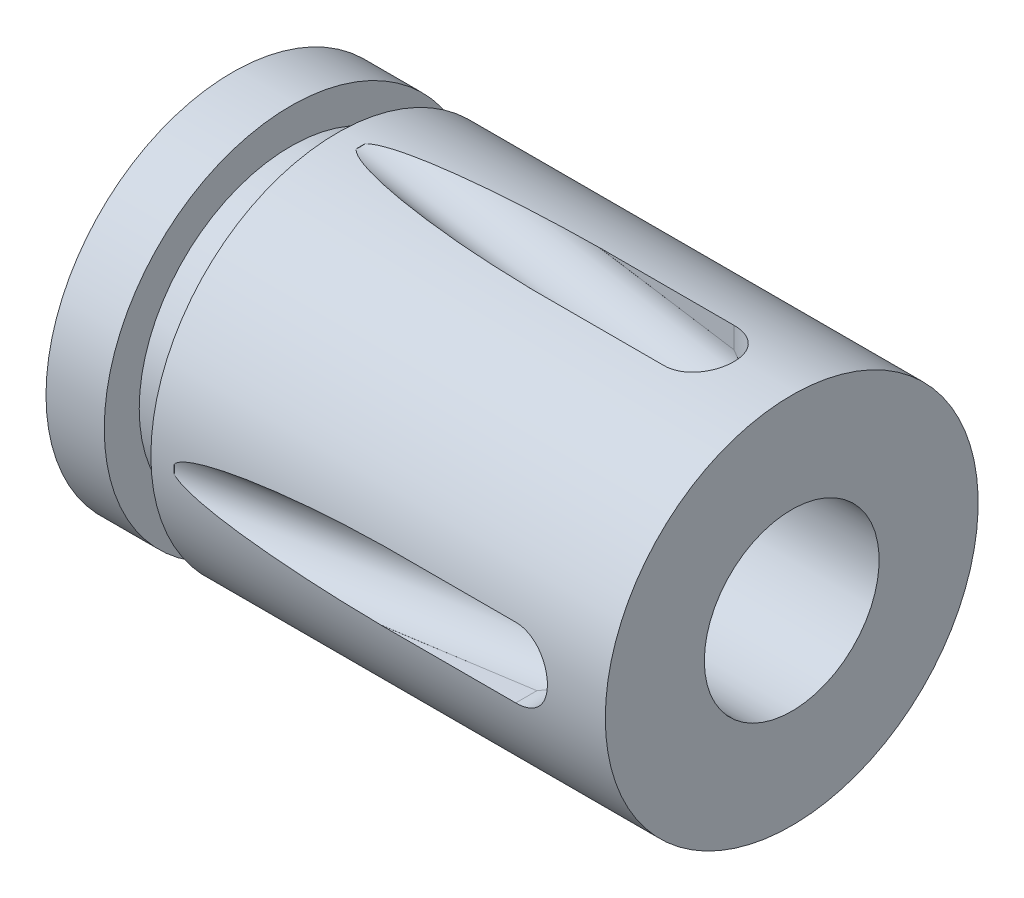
ISO-10303-21;
HEADER;
FILE_DESCRIPTION(('STEP AP214'),'2;1');
FILE_NAME('part.step','',(''),(''),'','','');
FILE_SCHEMA(('AUTOMOTIVE_DESIGN { 1 0 10303 214 1 1 1 1 }'));
ENDSEC;
DATA;
#1=APPLICATION_CONTEXT('core data for automotive mechanical design processes');
#2=APPLICATION_PROTOCOL_DEFINITION('international standard','automotive_design',2000,#1);
#3=PRODUCT_CONTEXT('',#1,'mechanical');
#4=PRODUCT('Part','Part','',(#3));
#5=PRODUCT_RELATED_PRODUCT_CATEGORY('part','',(#4));
#6=PRODUCT_DEFINITION_FORMATION('','',#4);
#7=PRODUCT_DEFINITION_CONTEXT('part definition',#1,'design');
#8=PRODUCT_DEFINITION('design','',#6,#7);
#9=PRODUCT_DEFINITION_SHAPE('','',#8);
#10=(LENGTH_UNIT() NAMED_UNIT(*) SI_UNIT(.MILLI.,.METRE.));
#11=(NAMED_UNIT(*) PLANE_ANGLE_UNIT() SI_UNIT($,.RADIAN.));
#12=(NAMED_UNIT(*) SI_UNIT($,.STERADIAN.) SOLID_ANGLE_UNIT());
#13=UNCERTAINTY_MEASURE_WITH_UNIT(LENGTH_MEASURE(1.E-05),#10,'distance_accuracy_value','');
#14=(GEOMETRIC_REPRESENTATION_CONTEXT(3) GLOBAL_UNCERTAINTY_ASSIGNED_CONTEXT((#13)) GLOBAL_UNIT_ASSIGNED_CONTEXT((#10,
#11,#12)) REPRESENTATION_CONTEXT('',''));
#15=CARTESIAN_POINT('',(0.,0.,0.));
#16=DIRECTION('',(0.,0.,1.));
#17=DIRECTION('',(1.,0.,0.));
#18=AXIS2_PLACEMENT_3D('',#15,#16,#17);
#19=CARTESIAN_POINT('',(-20.0427927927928,0.,0.));
#20=DIRECTION('',(-1.,0.,0.));
#21=DIRECTION('',(0.,0.,1.));
#22=AXIS2_PLACEMENT_3D('',#19,#20,#21);
#23=CYLINDRICAL_SURFACE('',#22,8.);
#24=CARTESIAN_POINT('',(5.49959391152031,-7.99769695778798,0.191946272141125));
#25=CARTESIAN_POINT('',(5.52297376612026,-7.99705854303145,0.218174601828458));
#26=CARTESIAN_POINT('',(5.54850641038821,-7.99636344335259,0.242134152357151));
#27=CARTESIAN_POINT('',(5.60229603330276,-7.99490407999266,0.286413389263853));
#28=CARTESIAN_POINT('',(5.63053265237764,-7.99414033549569,0.306757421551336));
#29=CARTESIAN_POINT('',(5.68813054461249,-7.99258822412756,0.344787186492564));
#30=CARTESIAN_POINT('',(5.71747188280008,-7.99180031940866,0.362504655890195));
#31=CARTESIAN_POINT('',(5.77722614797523,-7.99020179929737,0.396183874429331));
#32=CARTESIAN_POINT('',(5.80764125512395,-7.98939113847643,0.412141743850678));
#33=CARTESIAN_POINT('',(5.89209608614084,-7.98714901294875,0.45405563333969));
#34=CARTESIAN_POINT('',(5.9468344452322,-7.98570554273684,0.478590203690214));
#35=CARTESIAN_POINT('',(6.05755109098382,-7.98280695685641,0.524708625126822));
#36=CARTESIAN_POINT('',(6.11353016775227,-7.98135183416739,0.546290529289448));
#37=CARTESIAN_POINT('',(6.28273138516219,-7.97698658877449,0.607780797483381));
#38=CARTESIAN_POINT('',(6.39714210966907,-7.97407859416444,0.64439949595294));
#39=CARTESIAN_POINT('',(6.62992252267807,-7.96825636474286,0.712787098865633));
#40=CARTESIAN_POINT('',(6.74832507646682,-7.96534325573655,0.744439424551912));
#41=CARTESIAN_POINT('',(6.98604519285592,-7.95959552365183,0.803567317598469));
#42=CARTESIAN_POINT('',(7.10536179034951,-7.95676082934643,0.831046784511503));
#43=CARTESIAN_POINT('',(7.3430440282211,-7.95121753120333,0.882494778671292));
#44=CARTESIAN_POINT('',(7.46140053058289,-7.94850773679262,0.906505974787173));
#45=CARTESIAN_POINT('',(7.6985946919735,-7.94318143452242,0.952045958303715));
#46=CARTESIAN_POINT('',(7.81743237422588,-7.94056493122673,0.973574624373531));
#47=CARTESIAN_POINT('',(8.17453321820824,-7.9328632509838,1.03508682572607));
#48=CARTESIAN_POINT('',(8.41333108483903,-7.92792714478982,1.07198551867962));
#49=CARTESIAN_POINT('',(8.89207991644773,-7.91848256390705,1.13964268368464));
#50=CARTESIAN_POINT('',(9.13203193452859,-7.91397461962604,1.17039359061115));
#51=CARTESIAN_POINT('',(9.61250342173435,-7.905422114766,1.22683125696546));
#52=CARTESIAN_POINT('',(9.8530228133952,-7.90137749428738,1.25251867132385));
#53=CARTESIAN_POINT('',(10.3320436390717,-7.89381609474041,1.29931588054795));
#54=CARTESIAN_POINT('',(10.570540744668,-7.89029436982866,1.32046953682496));
#55=CARTESIAN_POINT('',(11.0478533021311,-7.88375530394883,1.35896265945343));
#56=CARTESIAN_POINT('',(11.2866687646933,-7.88073798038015,1.37630199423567));
#57=CARTESIAN_POINT('',(12.0031739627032,-7.87248384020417,1.42303297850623));
#58=CARTESIAN_POINT('',(12.4812292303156,-7.86803995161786,1.44716668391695));
#59=CARTESIAN_POINT('',(13.1173774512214,-7.86367725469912,1.47058057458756));
#60=CARTESIAN_POINT('',(13.2752741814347,-7.86272137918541,1.4756796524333));
#61=CARTESIAN_POINT('',(13.5911230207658,-7.86107128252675,1.48444607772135));
#62=CARTESIAN_POINT('',(13.7490751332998,-7.86037708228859,1.48811331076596));
#63=CARTESIAN_POINT('',(14.0655770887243,-7.85925665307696,1.49401935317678));
#64=CARTESIAN_POINT('',(14.2241270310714,-7.85883140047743,1.496252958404));
#65=CARTESIAN_POINT('',(14.541228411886,-7.85826151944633,1.49924201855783));
#66=CARTESIAN_POINT('',(14.6997798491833,-7.85811686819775,1.49999759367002));
#67=CARTESIAN_POINT('',(14.858331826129,-7.85811682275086,1.49999999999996));
#68=B_SPLINE_CURVE_WITH_KNOTS('',3,(#24,#25,#26,#27,#28,#29,#30,#31,#32,#33,#34,#35,#36,#37,#38,
#39,#40,#41,#42,#43,#44,#45,#46,#47,#48,#49,#50,#51,#52,#53,#54,#55,#56,#57,#58,#59,#60,#61,#62,
#63,#64,#65,#66,#67),.UNSPECIFIED.,.F.,.F.,(4,2,2,2,2,2,2,2,2,2,2,2,2,2,2,2,2,2,2,2,2,4),(0.,
0.10491860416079,0.209101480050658,0.311899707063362,0.414920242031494,0.594788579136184,
0.774774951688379,1.13499538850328,1.50270051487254,1.87005987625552,2.23242279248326,
2.59480341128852,3.31972727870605,4.04553777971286,4.77125434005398,5.48959683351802,
6.20796410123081,7.64377458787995,8.11771761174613,8.59169849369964,9.06739036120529,
9.54304354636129),.UNSPECIFIED.);
#69=CARTESIAN_POINT('',(5.49959391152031,-7.99769695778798,0.191946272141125));
#70=VERTEX_POINT('',#69);
#71=CARTESIAN_POINT('',(14.2264090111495,-7.85887258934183,1.49603530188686));
#72=VERTEX_POINT('',#71);
#73=EDGE_CURVE('E371',#70,#72,#68,.T.);
#74=ORIENTED_EDGE('',*,*,#73,.T.);
#75=CARTESIAN_POINT('',(64.2168919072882,0.,0.));
#76=DIRECTION('',(-0.155300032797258,0.987867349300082,0.));
#77=DIRECTION('',(-0.987867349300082,-0.155300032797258,0.));
#78=AXIS2_PLACEMENT_3D('',#75,#76,#77);
#79=ELLIPSE('',#78,51.5131893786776,8.);
#80=CARTESIAN_POINT('',(14.2312164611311,-7.85811682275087,1.49999999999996));
#81=VERTEX_POINT('',#80);
#82=EDGE_CURVE('E65',#72,#81,#79,.T.);
#83=ORIENTED_EDGE('',*,*,#82,.T.);
#84=DIRECTION('',(-1.,0.,0.));
#85=VECTOR('',#84,1.);
#86=CARTESIAN_POINT('',(-20.0427927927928,-7.85811682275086,1.49999999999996));
#87=LINE('',#86,#85);
#88=CARTESIAN_POINT('',(20.0146703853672,-7.85811682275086,1.49999999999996));
#89=VERTEX_POINT('',#88);
#90=EDGE_CURVE('E463',#81,#89,#87,.F.);
#91=ORIENTED_EDGE('',*,*,#90,.T.);
#92=CARTESIAN_POINT('',(20.0146703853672,-7.85811682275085,-1.50000000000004));
#93=CARTESIAN_POINT('',(20.0564755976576,-7.85811482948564,-1.50000016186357));
#94=CARTESIAN_POINT('',(20.0982604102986,-7.85845085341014,-1.49825121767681));
#95=CARTESIAN_POINT('',(20.1815236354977,-7.85977811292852,-1.49127686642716));
#96=CARTESIAN_POINT('',(20.2230020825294,-7.86076927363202,-1.48605185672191));
#97=CARTESIAN_POINT('',(20.3464036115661,-7.86468830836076,-1.46522686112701));
#98=CARTESIAN_POINT('',(20.4274883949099,-7.86856192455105,-1.4444766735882));
#99=CARTESIAN_POINT('',(20.5849440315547,-7.87838918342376,-1.38987171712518));
#100=CARTESIAN_POINT('',(20.661314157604,-7.88434314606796,-1.35601493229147));
#101=CARTESIAN_POINT('',(20.8073099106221,-7.897657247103,-1.27618255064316));
#102=CARTESIAN_POINT('',(20.8769350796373,-7.90501748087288,-1.23020613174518));
#103=CARTESIAN_POINT('',(21.0082987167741,-7.9204157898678,-1.12683904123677));
#104=CARTESIAN_POINT('',(21.0699416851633,-7.92846044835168,-1.06932802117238));
#105=CARTESIAN_POINT('',(21.1827699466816,-7.94426389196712,-0.94477773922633));
#106=CARTESIAN_POINT('',(21.2339536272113,-7.95202263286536,-0.87773701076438));
#107=CARTESIAN_POINT('',(21.3247711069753,-7.96645037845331,-0.735401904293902));
#108=CARTESIAN_POINT('',(21.3643141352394,-7.97311064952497,-0.660048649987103));
#109=CARTESIAN_POINT('',(21.430141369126,-7.984516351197,-0.503626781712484));
#110=CARTESIAN_POINT('',(21.4564273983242,-7.98926204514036,-0.422558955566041));
#111=CARTESIAN_POINT('',(21.4946997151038,-7.99625751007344,-0.258003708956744));
#112=CARTESIAN_POINT('',(21.5068484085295,-7.99853560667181,-0.174555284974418));
#113=CARTESIAN_POINT('',(21.5170073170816,-8.00043685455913,-0.00677365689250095));
#114=CARTESIAN_POINT('',(21.5150184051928,-8.00006016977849,0.0775594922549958));
#115=CARTESIAN_POINT('',(21.4970825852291,-7.99671633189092,0.243598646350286));
#116=CARTESIAN_POINT('',(21.4813109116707,-7.9937817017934,0.325324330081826));
#117=CARTESIAN_POINT('',(21.4365345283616,-7.98568822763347,0.484947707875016));
#118=CARTESIAN_POINT('',(21.4075294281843,-7.98052931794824,0.562845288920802));
#119=CARTESIAN_POINT('',(21.3369420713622,-7.96851249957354,0.713111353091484));
#120=CARTESIAN_POINT('',(21.2952895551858,-7.96164513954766,0.785446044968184));
#121=CARTESIAN_POINT('',(21.2006428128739,-7.94697120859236,0.922162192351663));
#122=CARTESIAN_POINT('',(21.1476478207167,-7.93916457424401,0.986543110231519));
#123=CARTESIAN_POINT('',(21.0308628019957,-7.92333619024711,1.10655759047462));
#124=CARTESIAN_POINT('',(20.9669207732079,-7.91531297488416,1.16204312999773));
#125=CARTESIAN_POINT('',(20.830538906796,-7.90006702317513,1.26154006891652));
#126=CARTESIAN_POINT('',(20.7580967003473,-7.89284451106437,1.30554825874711));
#127=CARTESIAN_POINT('',(20.6065640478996,-7.88001443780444,1.38088443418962));
#128=CARTESIAN_POINT('',(20.5274589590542,-7.87441056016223,1.41218356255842));
#129=CARTESIAN_POINT('',(20.3650366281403,-7.86550799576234,1.46096172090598));
#130=CARTESIAN_POINT('',(20.2817258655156,-7.86220587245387,1.47846135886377));
#131=CARTESIAN_POINT('',(20.1672464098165,-7.85953851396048,1.49253547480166));
#132=CARTESIAN_POINT('',(20.1367740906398,-7.85900592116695,1.49533572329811));
#133=CARTESIAN_POINT('',(20.0757625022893,-7.85829539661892,1.49906560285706));
#134=CARTESIAN_POINT('',(20.0452234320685,-7.85811686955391,1.49999837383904));
#135=CARTESIAN_POINT('',(20.0146703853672,-7.85811682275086,1.49999999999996));
#136=B_SPLINE_CURVE_WITH_KNOTS('',3,(#92,#93,#94,#95,#96,#97,#98,#99,#100,#101,#102,#103,#104,
#105,#106,#107,#108,#109,#110,#111,#112,#113,#114,#115,#116,#117,#118,#119,#120,#121,#122,#123,
#124,#125,#126,#127,#128,#129,#130,#131,#132,#133,#134,#135),.UNSPECIFIED.,.F.,.F.,(4,2,2,2,2,2,
2,2,2,2,2,2,2,2,2,2,2,2,2,2,2,4),(0.,0.125337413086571,0.250660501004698,0.500727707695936,
0.750833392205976,1.00095604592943,1.25383858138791,1.50676007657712,1.76160450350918,
2.01641386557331,2.26826621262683,2.52010300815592,2.76878377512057,3.01747187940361,
3.26756759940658,3.51768021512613,3.77159894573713,4.02558860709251,4.28015179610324,
4.53433409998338,4.62610503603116,4.71772154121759),.UNSPECIFIED.);
#137=CARTESIAN_POINT('',(20.0146703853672,-7.85811682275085,-1.50000000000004));
#138=VERTEX_POINT('',#137);
#139=EDGE_CURVE('E395',#138,#89,#136,.T.);
#140=ORIENTED_EDGE('',*,*,#139,.F.);
#141=DIRECTION('',(-1.,0.,0.));
#142=VECTOR('',#141,1.);
#143=CARTESIAN_POINT('',(-20.0427927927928,-7.85811682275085,-1.50000000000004));
#144=LINE('',#143,#142);
#145=CARTESIAN_POINT('',(14.2312164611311,-7.85811682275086,-1.50000000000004));
#146=VERTEX_POINT('',#145);
#147=EDGE_CURVE('E461',#146,#138,#144,.F.);
#148=ORIENTED_EDGE('',*,*,#147,.F.);
#149=CARTESIAN_POINT('',(14.2264090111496,-7.85887258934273,-1.4960353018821));
#150=VERTEX_POINT('',#149);
#151=EDGE_CURVE('E469',#146,#150,#79,.T.);
#152=ORIENTED_EDGE('',*,*,#151,.T.);
#153=CARTESIAN_POINT('',(14.858331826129,-7.85811682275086,-1.50000000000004));
#154=CARTESIAN_POINT('',(14.6076298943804,-7.85811710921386,-1.49998401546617));
#155=CARTESIAN_POINT('',(14.3569293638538,-7.85847859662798,-1.49810444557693));
#156=CARTESIAN_POINT('',(13.8555661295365,-7.85989056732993,-1.49068641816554));
#157=CARTESIAN_POINT('',(13.6049034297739,-7.86094110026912,-1.4851476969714));
#158=CARTESIAN_POINT('',(13.1048154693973,-7.86369153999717,-1.47051269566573));
#159=CARTESIAN_POINT('',(12.8553897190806,-7.8653885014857,-1.46143254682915));
#160=CARTESIAN_POINT('',(12.3567160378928,-7.86940084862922,-1.43967140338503));
#161=CARTESIAN_POINT('',(12.1074680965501,-7.8717161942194,-1.42699064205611));
#162=CARTESIAN_POINT('',(11.610168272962,-7.8769251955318,-1.39795084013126));
#163=CARTESIAN_POINT('',(11.3621155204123,-7.87981655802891,-1.38160635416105));
#164=CARTESIAN_POINT('',(10.8662605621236,-7.8861551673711,-1.3449547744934));
#165=CARTESIAN_POINT('',(10.6184584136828,-7.88960252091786,-1.32464692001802));
#166=CARTESIAN_POINT('',(10.1221714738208,-7.89704086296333,-1.27955942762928));
#167=CARTESIAN_POINT('',(9.87368844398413,-7.90103416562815,-1.25476059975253));
#168=CARTESIAN_POINT('',(9.37744986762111,-7.90952120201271,-1.20009967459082));
#169=CARTESIAN_POINT('',(9.12969395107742,-7.91401460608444,-1.1702409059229));
#170=CARTESIAN_POINT('',(8.6338325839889,-7.92349598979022,-1.10423887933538));
#171=CARTESIAN_POINT('',(8.38573090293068,-7.9284861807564,-1.06806692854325));
#172=CARTESIAN_POINT('',(8.01426444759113,-7.93630788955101,-1.00768192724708));
#173=CARTESIAN_POINT('',(7.89040260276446,-7.93897473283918,-0.986502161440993));
#174=CARTESIAN_POINT('',(7.6431422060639,-7.94441257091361,-0.941711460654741));
#175=CARTESIAN_POINT('',(7.51974357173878,-7.94718354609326,-0.91810098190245));
#176=CARTESIAN_POINT('',(7.27393720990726,-7.95281382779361,-0.867979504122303));
#177=CARTESIAN_POINT('',(7.15152758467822,-7.9556728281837,-0.841477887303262));
#178=CARTESIAN_POINT('',(6.90750211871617,-7.96147872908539,-0.784648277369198));
#179=CARTESIAN_POINT('',(6.78588692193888,-7.96442569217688,-0.754317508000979));
#180=CARTESIAN_POINT('',(6.54454026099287,-7.9703762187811,-0.688626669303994));
#181=CARTESIAN_POINT('',(6.42480291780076,-7.97337948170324,-0.653288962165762));
#182=CARTESIAN_POINT('',(6.24719497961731,-7.97790616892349,-0.594466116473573));
#183=CARTESIAN_POINT('',(6.18835969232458,-7.97941779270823,-0.573903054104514));
#184=CARTESIAN_POINT('',(6.07164854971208,-7.98243949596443,-0.530230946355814));
#185=CARTESIAN_POINT('',(6.01377230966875,-7.98394957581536,-0.507122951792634));
#186=CARTESIAN_POINT('',(5.92443712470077,-7.98629753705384,-0.468237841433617));
#187=CARTESIAN_POINT('',(5.89245946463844,-7.98714151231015,-0.453655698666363));
#188=CARTESIAN_POINT('',(5.82914483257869,-7.98881923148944,-0.423087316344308));
#189=CARTESIAN_POINT('',(5.7978083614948,-7.98965296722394,-0.407100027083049));
#190=CARTESIAN_POINT('',(5.7364059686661,-7.99129289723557,-0.373521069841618));
#191=CARTESIAN_POINT('',(5.7063304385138,-7.9920992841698,-0.355947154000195));
#192=CARTESIAN_POINT('',(5.64764486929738,-7.99367840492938,-0.318524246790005));
#193=CARTESIAN_POINT('',(5.61903298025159,-7.99445118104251,-0.298678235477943));
#194=CARTESIAN_POINT('',(5.57517868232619,-7.99563950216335,-0.264413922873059));
#195=CARTESIAN_POINT('',(5.55916533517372,-7.99607432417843,-0.250998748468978));
#196=CARTESIAN_POINT('',(5.5283325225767,-7.99691303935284,-0.222662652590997));
#197=CARTESIAN_POINT('',(5.51352225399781,-7.99731669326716,-0.207731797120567));
#198=CARTESIAN_POINT('',(5.49959391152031,-7.99769695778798,-0.19194627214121));
#199=B_SPLINE_CURVE_WITH_KNOTS('',3,(#153,#154,#155,#156,#157,#158,#159,#160,#161,#162,#163,
#164,#165,#166,#167,#168,#169,#170,#171,#172,#173,#174,#175,#176,#177,#178,#179,#180,#181,#182,
#183,#184,#185,#186,#187,#188,#189,#190,#191,#192,#193,#194,#195,#196,#197,#198),.UNSPECIFIED.,
.F.,.F.,(4,2,2,2,2,2,2,2,2,2,2,2,2,2,2,2,2,2,2,2,2,2,4),(0.,0.752096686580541,1.50424757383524,
2.25301167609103,3.00172727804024,3.74751962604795,4.49345527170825,5.24265692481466,
5.99136762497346,6.74357424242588,7.12061915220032,7.49759342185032,7.87337882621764,
8.2494382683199,8.62386818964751,8.81086119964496,8.99777728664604,9.10321985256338,
9.20874186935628,9.31320265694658,9.41752797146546,9.48013465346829,9.54318201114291),.UNSPECIFIED.);
#200=CARTESIAN_POINT('',(5.49959391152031,-7.99769695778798,-0.191946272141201));
#201=VERTEX_POINT('',#200);
#202=EDGE_CURVE('E379',#150,#201,#199,.T.);
#203=ORIENTED_EDGE('',*,*,#202,.T.);
#204=CARTESIAN_POINT('',(4.08938415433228,0.,0.));
#205=DIRECTION('',(-0.984807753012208,-0.173648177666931,0.));
#206=DIRECTION('',(-0.173648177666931,0.984807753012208,0.));
#207=AXIS2_PLACEMENT_3D('',#204,#205,#206);
#208=ELLIPSE('',#207,8.12341289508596,8.);
#209=EDGE_CURVE('E402',#201,#70,#208,.T.);
#210=ORIENTED_EDGE('',*,*,#209,.T.);
#211=EDGE_LOOP('',(#74,#83,#91,#140,#148,#152,#203,#210));
#212=FACE_BOUND('',#211,.T.);
#213=CARTESIAN_POINT('',(5.49959391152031,7.99769695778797,-0.191946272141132));
#214=CARTESIAN_POINT('',(5.52297376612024,7.99705854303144,-0.218174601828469));
#215=CARTESIAN_POINT('',(5.54850641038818,7.99636344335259,-0.242134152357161));
#216=CARTESIAN_POINT('',(5.60229603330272,7.99490407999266,-0.286413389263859));
#217=CARTESIAN_POINT('',(5.63053265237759,7.99414033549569,-0.306757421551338));
#218=CARTESIAN_POINT('',(5.68813054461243,7.99258822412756,-0.34478718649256));
#219=CARTESIAN_POINT('',(5.71747188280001,7.99180031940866,-0.362504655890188));
#220=CARTESIAN_POINT('',(5.77722614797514,7.99020179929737,-0.39618387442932));
#221=CARTESIAN_POINT('',(5.80764125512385,7.98939113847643,-0.412141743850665));
#222=CARTESIAN_POINT('',(5.89209608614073,7.98714901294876,-0.454055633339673));
#223=CARTESIAN_POINT('',(5.94683444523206,7.98570554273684,-0.478590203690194));
#224=CARTESIAN_POINT('',(6.05755109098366,7.98280695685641,-0.524708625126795));
#225=CARTESIAN_POINT('',(6.11353016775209,7.98135183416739,-0.546290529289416));
#226=CARTESIAN_POINT('',(6.28273138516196,7.97698658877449,-0.607780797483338));
#227=CARTESIAN_POINT('',(6.39714210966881,7.97407859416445,-0.644399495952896));
#228=CARTESIAN_POINT('',(6.62992252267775,7.96825636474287,-0.712787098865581));
#229=CARTESIAN_POINT('',(6.74832507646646,7.96534325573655,-0.744439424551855));
#230=CARTESIAN_POINT('',(6.98604519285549,7.95959552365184,-0.803567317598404));
#231=CARTESIAN_POINT('',(7.10536179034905,7.95676082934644,-0.831046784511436));
#232=CARTESIAN_POINT('',(7.34304402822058,7.95121753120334,-0.882494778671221));
#233=CARTESIAN_POINT('',(7.46140053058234,7.94850773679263,-0.9065059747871));
#234=CARTESIAN_POINT('',(7.69859469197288,7.94318143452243,-0.952045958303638));
#235=CARTESIAN_POINT('',(7.81743237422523,7.94056493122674,-0.973574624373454));
#236=CARTESIAN_POINT('',(8.17453321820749,7.93286325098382,-1.03508682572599));
#237=CARTESIAN_POINT('',(8.41333108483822,7.92792714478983,-1.07198551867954));
#238=CARTESIAN_POINT('',(8.89207991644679,7.91848256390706,-1.13964268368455));
#239=CARTESIAN_POINT('',(9.13203193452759,7.91397461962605,-1.17039359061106));
#240=CARTESIAN_POINT('',(9.61250342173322,7.90542211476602,-1.22683125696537));
#241=CARTESIAN_POINT('',(9.85302281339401,7.90137749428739,-1.25251867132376));
#242=CARTESIAN_POINT('',(10.3320436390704,7.89381609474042,-1.29931588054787));
#243=CARTESIAN_POINT('',(10.5705407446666,7.89029436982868,-1.32046953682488));
#244=CARTESIAN_POINT('',(11.0478533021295,7.88375530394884,-1.35896265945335));
#245=CARTESIAN_POINT('',(11.2866687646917,7.88073798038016,-1.37630199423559));
#246=CARTESIAN_POINT('',(12.0031739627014,7.87248384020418,-1.42303297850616));
#247=CARTESIAN_POINT('',(12.4812292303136,7.86803995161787,-1.4471666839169));
#248=CARTESIAN_POINT('',(13.1173774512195,7.86367725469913,-1.47058057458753));
#249=CARTESIAN_POINT('',(13.275274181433,7.86272137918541,-1.47567965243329));
#250=CARTESIAN_POINT('',(13.5911230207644,7.86107128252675,-1.48444607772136));
#251=CARTESIAN_POINT('',(13.7490751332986,7.86037708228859,-1.48811331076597));
#252=CARTESIAN_POINT('',(14.0655770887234,7.85925665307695,-1.4940193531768));
#253=CARTESIAN_POINT('',(14.2241270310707,7.85883140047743,-1.49625295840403));
#254=CARTESIAN_POINT('',(14.5412284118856,7.85826151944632,-1.49924201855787));
#255=CARTESIAN_POINT('',(14.6997798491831,7.85811686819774,-1.49999759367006));
#256=CARTESIAN_POINT('',(14.858331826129,7.85811682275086,-1.5));
#257=B_SPLINE_CURVE_WITH_KNOTS('',3,(#213,#214,#215,#216,#217,#218,#219,#220,#221,#222,#223,
#224,#225,#226,#227,#228,#229,#230,#231,#232,#233,#234,#235,#236,#237,#238,#239,#240,#241,#242,
#243,#244,#245,#246,#247,#248,#249,#250,#251,#252,#253,#254,#255,#256),.UNSPECIFIED.,.F.,.F.,(4,
2,2,2,2,2,2,2,2,2,2,2,2,2,2,2,2,2,2,2,2,4),(0.,0.104918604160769,0.209101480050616,
0.311899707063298,0.414920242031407,0.594788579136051,0.774774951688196,1.134995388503,
1.50270051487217,1.87005987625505,2.23242279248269,2.59480341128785,3.31972727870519,
4.04553777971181,4.77125434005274,5.48959683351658,6.20796410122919,7.64377458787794,
8.11771761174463,8.59169849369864,9.0673903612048,9.54304354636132),.UNSPECIFIED.);
#258=CARTESIAN_POINT('',(5.49959391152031,7.99769695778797,-0.191946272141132));
#259=VERTEX_POINT('',#258);
#260=CARTESIAN_POINT('',(14.2264090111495,7.85887258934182,-1.4960353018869));
#261=VERTEX_POINT('',#260);
#262=EDGE_CURVE('E296',#259,#261,#257,.T.);
#263=ORIENTED_EDGE('',*,*,#262,.T.);
#264=CARTESIAN_POINT('',(64.2168919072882,0.,0.));
#265=DIRECTION('',(-0.155300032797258,-0.987867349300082,0.));
#266=DIRECTION('',(-0.987867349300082,0.155300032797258,0.));
#267=AXIS2_PLACEMENT_3D('',#264,#265,#266);
#268=ELLIPSE('',#267,51.5131893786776,8.);
#269=CARTESIAN_POINT('',(14.2312164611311,7.85811682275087,-1.5));
#270=VERTEX_POINT('',#269);
#271=EDGE_CURVE('E252',#261,#270,#268,.T.);
#272=ORIENTED_EDGE('',*,*,#271,.T.);
#273=DIRECTION('',(-1.,0.,0.));
#274=VECTOR('',#273,1.);
#275=CARTESIAN_POINT('',(-20.0427927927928,7.85811682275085,-1.5));
#276=LINE('',#275,#274);
#277=CARTESIAN_POINT('',(20.0146703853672,7.85811682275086,-1.5));
#278=VERTEX_POINT('',#277);
#279=EDGE_CURVE('E247',#270,#278,#276,.F.);
#280=ORIENTED_EDGE('',*,*,#279,.T.);
#281=CARTESIAN_POINT('',(20.0146703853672,7.85811682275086,1.5));
#282=CARTESIAN_POINT('',(20.0564755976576,7.85811482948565,1.50000016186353));
#283=CARTESIAN_POINT('',(20.0982604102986,7.85845085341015,1.49825121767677));
#284=CARTESIAN_POINT('',(20.1815236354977,7.85977811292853,1.49127686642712));
#285=CARTESIAN_POINT('',(20.2230020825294,7.86076927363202,1.48605185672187));
#286=CARTESIAN_POINT('',(20.3464036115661,7.86468830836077,1.46522686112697));
#287=CARTESIAN_POINT('',(20.4274883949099,7.86856192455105,1.44447667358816));
#288=CARTESIAN_POINT('',(20.5849440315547,7.87838918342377,1.38987171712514));
#289=CARTESIAN_POINT('',(20.661314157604,7.88434314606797,1.35601493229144));
#290=CARTESIAN_POINT('',(20.8073099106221,7.89765724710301,1.27618255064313));
#291=CARTESIAN_POINT('',(20.8769350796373,7.90501748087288,1.23020613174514));
#292=CARTESIAN_POINT('',(21.0082987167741,7.92041578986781,1.12683904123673));
#293=CARTESIAN_POINT('',(21.0699416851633,7.92846044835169,1.06932802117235));
#294=CARTESIAN_POINT('',(21.1827699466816,7.94426389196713,0.944777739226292));
#295=CARTESIAN_POINT('',(21.2339536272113,7.95202263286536,0.877737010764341));
#296=CARTESIAN_POINT('',(21.3247711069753,7.96645037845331,0.735401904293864));
#297=CARTESIAN_POINT('',(21.3643141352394,7.97311064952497,0.660048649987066));
#298=CARTESIAN_POINT('',(21.430141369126,7.984516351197,0.503626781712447));
#299=CARTESIAN_POINT('',(21.4564273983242,7.98926204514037,0.422558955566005));
#300=CARTESIAN_POINT('',(21.4946997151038,7.99625751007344,0.258003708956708));
#301=CARTESIAN_POINT('',(21.5068484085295,7.99853560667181,0.174555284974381));
#302=CARTESIAN_POINT('',(21.5170073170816,8.00043685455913,0.00677365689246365));
#303=CARTESIAN_POINT('',(21.5150184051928,8.00006016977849,-0.0775594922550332));
#304=CARTESIAN_POINT('',(21.4970825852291,7.99671633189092,-0.243598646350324));
#305=CARTESIAN_POINT('',(21.4813109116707,7.9937817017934,-0.325324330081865));
#306=CARTESIAN_POINT('',(21.4365345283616,7.98568822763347,-0.484947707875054));
#307=CARTESIAN_POINT('',(21.4075294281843,7.98052931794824,-0.56284528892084));
#308=CARTESIAN_POINT('',(21.3369420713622,7.96851249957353,-0.713111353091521));
#309=CARTESIAN_POINT('',(21.2952895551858,7.96164513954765,-0.785446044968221));
#310=CARTESIAN_POINT('',(21.2006428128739,7.94697120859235,-0.922162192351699));
#311=CARTESIAN_POINT('',(21.1476478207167,7.93916457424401,-0.986543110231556));
#312=CARTESIAN_POINT('',(21.0308628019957,7.92333619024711,-1.10655759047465));
#313=CARTESIAN_POINT('',(20.9669207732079,7.91531297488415,-1.16204312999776));
#314=CARTESIAN_POINT('',(20.830538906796,7.90006702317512,-1.26154006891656));
#315=CARTESIAN_POINT('',(20.7580967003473,7.89284451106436,-1.30554825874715));
#316=CARTESIAN_POINT('',(20.6065640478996,7.88001443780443,-1.38088443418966));
#317=CARTESIAN_POINT('',(20.5274589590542,7.87441056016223,-1.41218356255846));
#318=CARTESIAN_POINT('',(20.3650366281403,7.86550799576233,-1.46096172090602));
#319=CARTESIAN_POINT('',(20.2817258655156,7.86220587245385,-1.47846135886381));
#320=CARTESIAN_POINT('',(20.1672464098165,7.85953851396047,-1.4925354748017));
#321=CARTESIAN_POINT('',(20.1367740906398,7.85900592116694,-1.49533572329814));
#322=CARTESIAN_POINT('',(20.0757625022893,7.85829539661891,-1.49906560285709));
#323=CARTESIAN_POINT('',(20.0452234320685,7.85811686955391,-1.49999837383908));
#324=CARTESIAN_POINT('',(20.0146703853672,7.85811682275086,-1.5));
#325=B_SPLINE_CURVE_WITH_KNOTS('',3,(#281,#282,#283,#284,#285,#286,#287,#288,#289,#290,#291,
#292,#293,#294,#295,#296,#297,#298,#299,#300,#301,#302,#303,#304,#305,#306,#307,#308,#309,#310,
#311,#312,#313,#314,#315,#316,#317,#318,#319,#320,#321,#322,#323,#324),.UNSPECIFIED.,.F.,.F.,(4,
2,2,2,2,2,2,2,2,2,2,2,2,2,2,2,2,2,2,2,2,4),(0.,0.125337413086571,0.250660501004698,
0.500727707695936,0.750833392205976,1.00095604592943,1.25383858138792,1.50676007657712,
1.76160450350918,2.01641386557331,2.26826621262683,2.52010300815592,2.76878377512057,
3.01747187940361,3.26756759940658,3.51768021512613,3.77159894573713,4.02558860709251,
4.28015179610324,4.53433409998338,4.62610503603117,4.71772154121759),.UNSPECIFIED.);
#326=CARTESIAN_POINT('',(20.0146703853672,7.85811682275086,1.5));
#327=VERTEX_POINT('',#326);
#328=EDGE_CURVE('E328',#327,#278,#325,.T.);
#329=ORIENTED_EDGE('',*,*,#328,.F.);
#330=DIRECTION('',(-1.,0.,0.));
#331=VECTOR('',#330,1.);
#332=CARTESIAN_POINT('',(-20.0427927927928,7.85811682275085,1.5));
#333=LINE('',#332,#331);
#334=CARTESIAN_POINT('',(14.2312164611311,7.85811682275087,1.5));
#335=VERTEX_POINT('',#334);
#336=EDGE_CURVE('E245',#335,#327,#333,.F.);
#337=ORIENTED_EDGE('',*,*,#336,.F.);
#338=CARTESIAN_POINT('',(14.2264090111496,7.85887258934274,1.49603530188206));
#339=VERTEX_POINT('',#338);
#340=EDGE_CURVE('E256',#335,#339,#268,.T.);
#341=ORIENTED_EDGE('',*,*,#340,.T.);
#342=CARTESIAN_POINT('',(14.858331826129,7.85811682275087,1.5));
#343=CARTESIAN_POINT('',(14.6076298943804,7.85811710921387,1.49998401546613));
#344=CARTESIAN_POINT('',(14.3569293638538,7.85847859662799,1.49810444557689));
#345=CARTESIAN_POINT('',(13.8555661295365,7.85989056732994,1.49068641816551));
#346=CARTESIAN_POINT('',(13.6049034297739,7.86094110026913,1.48514769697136));
#347=CARTESIAN_POINT('',(13.1048154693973,7.86369153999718,1.4705126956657));
#348=CARTESIAN_POINT('',(12.8553897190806,7.86538850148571,1.46143254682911));
#349=CARTESIAN_POINT('',(12.3567160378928,7.86940084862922,1.43967140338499));
#350=CARTESIAN_POINT('',(12.1074680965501,7.8717161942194,1.42699064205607));
#351=CARTESIAN_POINT('',(11.610168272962,7.8769251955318,1.39795084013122));
#352=CARTESIAN_POINT('',(11.3621155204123,7.87981655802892,1.38160635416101));
#353=CARTESIAN_POINT('',(10.8662605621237,7.8861551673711,1.34495477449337));
#354=CARTESIAN_POINT('',(10.6184584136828,7.88960252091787,1.32464692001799));
#355=CARTESIAN_POINT('',(10.1221714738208,7.89704086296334,1.27955942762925));
#356=CARTESIAN_POINT('',(9.87368844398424,7.90103416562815,1.2547605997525));
#357=CARTESIAN_POINT('',(9.37744986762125,7.90952120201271,1.2000996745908));
#358=CARTESIAN_POINT('',(9.12969395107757,7.91401460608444,1.17024090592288));
#359=CARTESIAN_POINT('',(8.63383258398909,7.92349598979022,1.10423887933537));
#360=CARTESIAN_POINT('',(8.38573090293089,7.9284861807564,1.06806692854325));
#361=CARTESIAN_POINT('',(8.01426444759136,7.93630788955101,1.00768192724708));
#362=CARTESIAN_POINT('',(7.8904026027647,7.93897473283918,0.986502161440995));
#363=CARTESIAN_POINT('',(7.64314220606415,7.94441257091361,0.94171146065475));
#364=CARTESIAN_POINT('',(7.51974357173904,7.94718354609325,0.918100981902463));
#365=CARTESIAN_POINT('',(7.27393720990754,7.9528138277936,0.867979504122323));
#366=CARTESIAN_POINT('',(7.1515275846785,7.9556728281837,0.841477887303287));
#367=CARTESIAN_POINT('',(6.90750211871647,7.96147872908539,0.78464827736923));
#368=CARTESIAN_POINT('',(6.78588692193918,7.96442569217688,0.754317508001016));
#369=CARTESIAN_POINT('',(6.54454026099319,7.9703762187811,0.688626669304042));
#370=CARTESIAN_POINT('',(6.42480291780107,7.97337948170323,0.653288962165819));
#371=CARTESIAN_POINT('',(6.24719497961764,7.97790616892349,0.594466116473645));
#372=CARTESIAN_POINT('',(6.1883596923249,7.97941779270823,0.573903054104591));
#373=CARTESIAN_POINT('',(6.07164854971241,7.98243949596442,0.530230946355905));
#374=CARTESIAN_POINT('',(6.01377230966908,7.98394957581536,0.507122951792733));
#375=CARTESIAN_POINT('',(5.92443712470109,7.98629753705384,0.46823784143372));
#376=CARTESIAN_POINT('',(5.89245946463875,7.98714151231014,0.453655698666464));
#377=CARTESIAN_POINT('',(5.82914483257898,7.98881923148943,0.423087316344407));
#378=CARTESIAN_POINT('',(5.79780836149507,7.98965296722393,0.40710002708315));
#379=CARTESIAN_POINT('',(5.73640596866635,7.99129289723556,0.373521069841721));
#380=CARTESIAN_POINT('',(5.70633043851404,7.9920992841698,0.355947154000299));
#381=CARTESIAN_POINT('',(5.64764486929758,7.99367840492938,0.318524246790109));
#382=CARTESIAN_POINT('',(5.61903298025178,7.9944511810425,0.298678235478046));
#383=CARTESIAN_POINT('',(5.57517868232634,7.99563950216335,0.264413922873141));
#384=CARTESIAN_POINT('',(5.55916533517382,7.99607432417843,0.250998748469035));
#385=CARTESIAN_POINT('',(5.52833252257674,7.99691303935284,0.222662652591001));
#386=CARTESIAN_POINT('',(5.51352225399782,7.99731669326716,0.20773179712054));
#387=CARTESIAN_POINT('',(5.49959391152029,7.99769695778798,0.191946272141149));
#388=B_SPLINE_CURVE_WITH_KNOTS('',3,(#342,#343,#344,#345,#346,#347,#348,#349,#350,#351,#352,
#353,#354,#355,#356,#357,#358,#359,#360,#361,#362,#363,#364,#365,#366,#367,#368,#369,#370,#371,
#372,#373,#374,#375,#376,#377,#378,#379,#380,#381,#382,#383,#384,#385,#386,#387),.UNSPECIFIED.,
.F.,.F.,(4,2,2,2,2,2,2,2,2,2,2,2,2,2,2,2,2,2,2,2,2,2,4),(0.,0.752096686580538,1.50424757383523,
2.25301167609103,3.00172727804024,3.74751962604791,4.49345527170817,5.24265692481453,
5.99136762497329,6.74357424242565,7.12061915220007,7.49759342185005,7.87337882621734,
8.24943826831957,8.62386818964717,8.81086119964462,8.99777728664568,9.10321985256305,
9.20874186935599,9.31320265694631,9.41752797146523,9.48013465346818,9.54318201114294),.UNSPECIFIED.);
#389=CARTESIAN_POINT('',(5.49959391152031,7.99769695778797,0.191946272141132));
#390=VERTEX_POINT('',#389);
#391=EDGE_CURVE('E303',#339,#390,#388,.T.);
#392=ORIENTED_EDGE('',*,*,#391,.T.);
#393=CARTESIAN_POINT('',(4.08938415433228,0.,0.));
#394=DIRECTION('',(-0.984807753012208,0.173648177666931,0.));
#395=DIRECTION('',(-0.173648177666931,-0.984807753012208,0.));
#396=AXIS2_PLACEMENT_3D('',#393,#394,#395);
#397=ELLIPSE('',#396,8.12341289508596,8.);
#398=EDGE_CURVE('E335',#390,#259,#397,.T.);
#399=ORIENTED_EDGE('',*,*,#398,.T.);
#400=EDGE_LOOP('',(#263,#272,#280,#329,#337,#341,#392,#399));
#401=FACE_BOUND('',#400,.T.);
#402=CARTESIAN_POINT('',(4.5,0.,0.));
#403=DIRECTION('',(-1.,0.,0.));
#404=DIRECTION('',(0.,0.,1.));
#405=AXIS2_PLACEMENT_3D('',#402,#403,#404);
#406=CIRCLE('',#405,8.);
#407=CARTESIAN_POINT('',(4.5,0.,8.));
#408=VERTEX_POINT('',#407);
#409=EDGE_CURVE('E278',#408,#408,#406,.T.);
#410=ORIENTED_EDGE('',*,*,#409,.F.);
#411=EDGE_LOOP('',(#410));
#412=FACE_BOUND('',#411,.T.);
#413=CARTESIAN_POINT('',(24.,0.,0.));
#414=DIRECTION('',(-1.,0.,0.));
#415=DIRECTION('',(0.,0.,1.));
#416=AXIS2_PLACEMENT_3D('',#413,#414,#415);
#417=CIRCLE('',#416,8.);
#418=CARTESIAN_POINT('',(24.,0.,8.));
#419=VERTEX_POINT('',#418);
#420=EDGE_CURVE('E275',#419,#419,#417,.T.);
#421=ORIENTED_EDGE('',*,*,#420,.T.);
#422=EDGE_LOOP('',(#421));
#423=FACE_BOUND('',#422,.T.);
#424=CARTESIAN_POINT('',(5.4995939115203,0.19194627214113,7.99769695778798));
#425=CARTESIAN_POINT('',(5.52297376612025,0.218174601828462,7.99705854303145));
#426=CARTESIAN_POINT('',(5.54850641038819,0.242134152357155,7.99636344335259));
#427=CARTESIAN_POINT('',(5.60229603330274,0.286413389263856,7.99490407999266));
#428=CARTESIAN_POINT('',(5.63053265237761,0.306757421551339,7.99414033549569));
#429=CARTESIAN_POINT('',(5.68813054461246,0.344787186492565,7.99258822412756));
#430=CARTESIAN_POINT('',(5.71747188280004,0.362504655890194,7.99180031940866));
#431=CARTESIAN_POINT('',(5.77722614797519,0.396183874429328,7.99020179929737));
#432=CARTESIAN_POINT('',(5.8076412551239,0.412141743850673,7.98939113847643));
#433=CARTESIAN_POINT('',(5.89209608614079,0.454055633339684,7.98714901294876));
#434=CARTESIAN_POINT('',(5.94683444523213,0.478590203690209,7.98570554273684));
#435=CARTESIAN_POINT('',(6.05755109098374,0.524708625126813,7.98280695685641));
#436=CARTESIAN_POINT('',(6.11353016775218,0.546290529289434,7.98135183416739));
#437=CARTESIAN_POINT('',(6.28273138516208,0.607780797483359,7.97698658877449));
#438=CARTESIAN_POINT('',(6.39714210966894,0.644399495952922,7.97407859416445));
#439=CARTESIAN_POINT('',(6.62992252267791,0.712787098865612,7.96825636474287));
#440=CARTESIAN_POINT('',(6.74832507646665,0.744439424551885,7.96534325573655));
#441=CARTESIAN_POINT('',(6.98604519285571,0.803567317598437,7.95959552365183));
#442=CARTESIAN_POINT('',(7.10536179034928,0.831046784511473,7.95676082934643));
#443=CARTESIAN_POINT('',(7.34304402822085,0.882494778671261,7.95121753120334));
#444=CARTESIAN_POINT('',(7.46140053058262,0.906505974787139,7.94850773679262));
#445=CARTESIAN_POINT('',(7.6985946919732,0.952045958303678,7.94318143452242));
#446=CARTESIAN_POINT('',(7.81743237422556,0.973574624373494,7.94056493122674));
#447=CARTESIAN_POINT('',(8.17453321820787,1.03508682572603,7.93286325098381));
#448=CARTESIAN_POINT('',(8.41333108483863,1.07198551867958,7.92792714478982));
#449=CARTESIAN_POINT('',(8.89207991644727,1.13964268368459,7.91848256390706));
#450=CARTESIAN_POINT('',(9.1320319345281,1.17039359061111,7.91397461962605));
#451=CARTESIAN_POINT('',(9.61250342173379,1.22683125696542,7.90542211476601));
#452=CARTESIAN_POINT('',(9.85302281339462,1.2525186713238,7.90137749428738));
#453=CARTESIAN_POINT('',(10.332043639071,1.29931588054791,7.89381609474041));
#454=CARTESIAN_POINT('',(10.5705407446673,1.32046953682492,7.89029436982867));
#455=CARTESIAN_POINT('',(11.0478533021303,1.35896265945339,7.88375530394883));
#456=CARTESIAN_POINT('',(11.2866687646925,1.37630199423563,7.88073798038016));
#457=CARTESIAN_POINT('',(12.0031739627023,1.4230329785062,7.87248384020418));
#458=CARTESIAN_POINT('',(12.4812292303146,1.44716668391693,7.86803995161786));
#459=CARTESIAN_POINT('',(13.1173774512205,1.47058057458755,7.86367725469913));
#460=CARTESIAN_POINT('',(13.2752741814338,1.47567965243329,7.86272137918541));
#461=CARTESIAN_POINT('',(13.5911230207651,1.48444607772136,7.86107128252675));
#462=CARTESIAN_POINT('',(13.7490751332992,1.48811331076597,7.86037708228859));
#463=CARTESIAN_POINT('',(14.0655770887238,1.49401935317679,7.85925665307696));
#464=CARTESIAN_POINT('',(14.2241270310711,1.49625295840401,7.85883140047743));
#465=CARTESIAN_POINT('',(14.5412284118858,1.49924201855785,7.85826151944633));
#466=CARTESIAN_POINT('',(14.6997798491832,1.49999759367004,7.85811686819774));
#467=CARTESIAN_POINT('',(14.858331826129,1.49999999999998,7.85811682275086));
#468=B_SPLINE_CURVE_WITH_KNOTS('',3,(#424,#425,#426,#427,#428,#429,#430,#431,#432,#433,#434,
#435,#436,#437,#438,#439,#440,#441,#442,#443,#444,#445,#446,#447,#448,#449,#450,#451,#452,#453,
#454,#455,#456,#457,#458,#459,#460,#461,#462,#463,#464,#465,#466,#467),.UNSPECIFIED.,.F.,.F.,(4,
2,2,2,2,2,2,2,2,2,2,2,2,2,2,2,2,2,2,2,2,4),(0.,0.10491860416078,0.20910148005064,
0.311899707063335,0.414920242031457,0.594788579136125,0.774774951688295,1.13499538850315,
1.50270051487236,1.8700598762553,2.23242279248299,2.5948034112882,3.31972727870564,
4.04553777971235,4.77125434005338,5.48959683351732,6.20796410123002,7.64377458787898,
8.1177176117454,8.59169849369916,9.06739036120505,9.54304354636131),.UNSPECIFIED.);
#469=CARTESIAN_POINT('',(5.49959391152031,0.19194627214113,7.99769695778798));
#470=VERTEX_POINT('',#469);
#471=CARTESIAN_POINT('',(14.2264090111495,1.49603530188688,7.85887258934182));
#472=VERTEX_POINT('',#471);
#473=EDGE_CURVE('E334',#470,#472,#468,.T.);
#474=ORIENTED_EDGE('',*,*,#473,.T.);
#475=CARTESIAN_POINT('',(64.2168919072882,0.,0.));
#476=DIRECTION('',(-0.155300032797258,0.,-0.987867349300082));
#477=DIRECTION('',(-0.987867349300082,0.,0.155300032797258));
#478=AXIS2_PLACEMENT_3D('',#475,#476,#477);
#479=ELLIPSE('',#478,51.5131893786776,8.);
#480=CARTESIAN_POINT('',(14.2312164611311,1.49999999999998,7.85811682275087));
#481=VERTEX_POINT('',#480);
#482=EDGE_CURVE('E482',#472,#481,#479,.T.);
#483=ORIENTED_EDGE('',*,*,#482,.T.);
#484=DIRECTION('',(-1.,0.,0.));
#485=VECTOR('',#484,1.);
#486=CARTESIAN_POINT('',(-20.0427927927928,1.49999999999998,7.85811682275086));
#487=LINE('',#486,#485);
#488=CARTESIAN_POINT('',(20.0146703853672,1.49999999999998,7.85811682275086));
#489=VERTEX_POINT('',#488);
#490=EDGE_CURVE('E478',#481,#489,#487,.F.);
#491=ORIENTED_EDGE('',*,*,#490,.T.);
#492=CARTESIAN_POINT('',(20.0146703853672,-1.50000000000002,7.85811682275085));
#493=CARTESIAN_POINT('',(20.0564755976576,-1.50000016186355,7.85811482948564));
#494=CARTESIAN_POINT('',(20.0982604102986,-1.49825121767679,7.85845085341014));
#495=CARTESIAN_POINT('',(20.1815236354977,-1.49127686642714,7.85977811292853));
#496=CARTESIAN_POINT('',(20.2230020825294,-1.48605185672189,7.86076927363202));
#497=CARTESIAN_POINT('',(20.3464036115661,-1.46522686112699,7.86468830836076));
#498=CARTESIAN_POINT('',(20.4274883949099,-1.44447667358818,7.86856192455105));
#499=CARTESIAN_POINT('',(20.5849440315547,-1.38987171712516,7.87838918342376));
#500=CARTESIAN_POINT('',(20.661314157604,-1.35601493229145,7.88434314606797));
#501=CARTESIAN_POINT('',(20.8073099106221,-1.27618255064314,7.897657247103));
#502=CARTESIAN_POINT('',(20.8769350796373,-1.23020613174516,7.90501748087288));
#503=CARTESIAN_POINT('',(21.0082987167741,-1.12683904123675,7.9204157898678));
#504=CARTESIAN_POINT('',(21.0699416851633,-1.06932802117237,7.92846044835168));
#505=CARTESIAN_POINT('',(21.1827699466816,-0.944777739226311,7.94426389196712));
#506=CARTESIAN_POINT('',(21.2339536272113,-0.877737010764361,7.95202263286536));
#507=CARTESIAN_POINT('',(21.3247711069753,-0.735401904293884,7.96645037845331));
#508=CARTESIAN_POINT('',(21.3643141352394,-0.660048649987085,7.97311064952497));
#509=CARTESIAN_POINT('',(21.430141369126,-0.503626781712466,7.984516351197));
#510=CARTESIAN_POINT('',(21.4564273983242,-0.422558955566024,7.98926204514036));
#511=CARTESIAN_POINT('',(21.4946997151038,-0.258003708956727,7.99625751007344));
#512=CARTESIAN_POINT('',(21.5068484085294,-0.1745552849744,7.99853560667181));
#513=CARTESIAN_POINT('',(21.5170073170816,-0.00677365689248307,8.00043685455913));
#514=CARTESIAN_POINT('',(21.5150184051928,0.0775594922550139,8.00006016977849));
#515=CARTESIAN_POINT('',(21.4970825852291,0.243598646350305,7.99671633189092));
#516=CARTESIAN_POINT('',(21.4813109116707,0.325324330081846,7.9937817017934));
#517=CARTESIAN_POINT('',(21.4365345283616,0.484947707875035,7.98568822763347));
#518=CARTESIAN_POINT('',(21.4075294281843,0.56284528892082,7.98052931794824));
#519=CARTESIAN_POINT('',(21.3369420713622,0.713111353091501,7.96851249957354));
#520=CARTESIAN_POINT('',(21.2952895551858,0.785446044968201,7.96164513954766));
#521=CARTESIAN_POINT('',(21.2006428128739,0.92216219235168,7.94697120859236));
#522=CARTESIAN_POINT('',(21.1476478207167,0.986543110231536,7.93916457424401));
#523=CARTESIAN_POINT('',(21.0308628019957,1.10655759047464,7.92333619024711));
#524=CARTESIAN_POINT('',(20.9669207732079,1.16204312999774,7.91531297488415));
#525=CARTESIAN_POINT('',(20.830538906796,1.26154006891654,7.90006702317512));
#526=CARTESIAN_POINT('',(20.7580967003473,1.30554825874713,7.89284451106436));
#527=CARTESIAN_POINT('',(20.6065640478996,1.38088443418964,7.88001443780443));
#528=CARTESIAN_POINT('',(20.5274589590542,1.41218356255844,7.87441056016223));
#529=CARTESIAN_POINT('',(20.3650366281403,1.460961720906,7.86550799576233));
#530=CARTESIAN_POINT('',(20.2817258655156,1.47846135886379,7.86220587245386));
#531=CARTESIAN_POINT('',(20.1672464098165,1.49253547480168,7.85953851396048));
#532=CARTESIAN_POINT('',(20.1367740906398,1.49533572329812,7.85900592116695));
#533=CARTESIAN_POINT('',(20.0757625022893,1.49906560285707,7.85829539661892));
#534=CARTESIAN_POINT('',(20.0452234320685,1.49999837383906,7.85811686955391));
#535=CARTESIAN_POINT('',(20.0146703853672,1.49999999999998,7.85811682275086));
#536=B_SPLINE_CURVE_WITH_KNOTS('',3,(#492,#493,#494,#495,#496,#497,#498,#499,#500,#501,#502,
#503,#504,#505,#506,#507,#508,#509,#510,#511,#512,#513,#514,#515,#516,#517,#518,#519,#520,#521,
#522,#523,#524,#525,#526,#527,#528,#529,#530,#531,#532,#533,#534,#535),.UNSPECIFIED.,.F.,.F.,(4,
2,2,2,2,2,2,2,2,2,2,2,2,2,2,2,2,2,2,2,2,4),(0.,0.125337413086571,0.250660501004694,
0.500727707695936,0.75083339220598,1.00095604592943,1.25383858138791,1.50676007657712,
1.76160450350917,2.01641386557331,2.26826621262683,2.52010300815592,2.76878377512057,
3.01747187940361,3.26756759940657,3.51768021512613,3.77159894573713,4.02558860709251,
4.28015179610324,4.53433409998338,4.62610503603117,4.71772154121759),.UNSPECIFIED.);
#537=CARTESIAN_POINT('',(20.0146703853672,-1.50000000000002,7.85811682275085));
#538=VERTEX_POINT('',#537);
#539=EDGE_CURVE('E365',#538,#489,#536,.T.);
#540=ORIENTED_EDGE('',*,*,#539,.F.);
#541=DIRECTION('',(-1.,0.,0.));
#542=VECTOR('',#541,1.);
#543=CARTESIAN_POINT('',(-20.0427927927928,-1.50000000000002,7.85811682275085));
#544=LINE('',#543,#542);
#545=CARTESIAN_POINT('',(14.2312164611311,-1.50000000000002,7.85811682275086));
#546=VERTEX_POINT('',#545);
#547=EDGE_CURVE('E476',#546,#538,#544,.F.);
#548=ORIENTED_EDGE('',*,*,#547,.F.);
#549=CARTESIAN_POINT('',(14.2264090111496,-1.49603530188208,7.85887258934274));
#550=VERTEX_POINT('',#549);
#551=EDGE_CURVE('E212',#546,#550,#479,.T.);
#552=ORIENTED_EDGE('',*,*,#551,.T.);
#553=CARTESIAN_POINT('',(14.858331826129,-1.50000000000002,7.85811682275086));
#554=CARTESIAN_POINT('',(14.6076298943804,-1.49998401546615,7.85811710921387));
#555=CARTESIAN_POINT('',(14.3569293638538,-1.49810444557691,7.85847859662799));
#556=CARTESIAN_POINT('',(13.8555661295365,-1.49068641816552,7.85989056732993));
#557=CARTESIAN_POINT('',(13.6049034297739,-1.48514769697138,7.86094110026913));
#558=CARTESIAN_POINT('',(13.1048154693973,-1.47051269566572,7.86369153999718));
#559=CARTESIAN_POINT('',(12.8553897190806,-1.46143254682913,7.8653885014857));
#560=CARTESIAN_POINT('',(12.3567160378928,-1.43967140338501,7.86940084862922));
#561=CARTESIAN_POINT('',(12.1074680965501,-1.42699064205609,7.8717161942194));
#562=CARTESIAN_POINT('',(11.610168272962,-1.39795084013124,7.8769251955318));
#563=CARTESIAN_POINT('',(11.3621155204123,-1.38160635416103,7.87981655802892));
#564=CARTESIAN_POINT('',(10.8662605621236,-1.34495477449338,7.8861551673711));
#565=CARTESIAN_POINT('',(10.6184584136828,-1.32464692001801,7.88960252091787));
#566=CARTESIAN_POINT('',(10.1221714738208,-1.27955942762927,7.89704086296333));
#567=CARTESIAN_POINT('',(9.8736884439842,-1.25476059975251,7.90103416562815));
#568=CARTESIAN_POINT('',(9.37744986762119,-1.20009967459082,7.90952120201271));
#569=CARTESIAN_POINT('',(9.12969395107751,-1.17024090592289,7.91401460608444));
#570=CARTESIAN_POINT('',(8.63383258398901,-1.10423887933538,7.92349598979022));
#571=CARTESIAN_POINT('',(8.3857309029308,-1.06806692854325,7.9284861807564));
#572=CARTESIAN_POINT('',(8.01426444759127,-1.00768192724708,7.93630788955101));
#573=CARTESIAN_POINT('',(7.8904026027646,-0.986502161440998,7.93897473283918));
#574=CARTESIAN_POINT('',(7.64314220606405,-0.94171146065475,7.94441257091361));
#575=CARTESIAN_POINT('',(7.51974357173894,-0.918100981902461,7.94718354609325));
#576=CARTESIAN_POINT('',(7.27393720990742,-0.867979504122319,7.9528138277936));
#577=CARTESIAN_POINT('',(7.15152758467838,-0.841477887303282,7.9556728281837));
#578=CARTESIAN_POINT('',(6.90750211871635,-0.784648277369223,7.96147872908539));
#579=CARTESIAN_POINT('',(6.78588692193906,-0.754317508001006,7.96442569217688));
#580=CARTESIAN_POINT('',(6.54454026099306,-0.688626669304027,7.9703762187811));
#581=CARTESIAN_POINT('',(6.42480291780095,-0.6532889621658,7.97337948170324));
#582=CARTESIAN_POINT('',(6.24719497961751,-0.59446611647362,7.97790616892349));
#583=CARTESIAN_POINT('',(6.18835969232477,-0.573903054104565,7.97941779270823));
#584=CARTESIAN_POINT('',(6.07164854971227,-0.530230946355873,7.98243949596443));
#585=CARTESIAN_POINT('',(6.01377230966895,-0.507122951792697,7.98394957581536));
#586=CARTESIAN_POINT('',(5.92443712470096,-0.468237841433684,7.98629753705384));
#587=CARTESIAN_POINT('',(5.89245946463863,-0.45365569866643,7.98714151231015));
#588=CARTESIAN_POINT('',(5.82914483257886,-0.423087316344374,7.98881923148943));
#589=CARTESIAN_POINT('',(5.79780836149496,-0.407100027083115,7.98965296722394));
#590=CARTESIAN_POINT('',(5.73640596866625,-0.373521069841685,7.99129289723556));
#591=CARTESIAN_POINT('',(5.70633043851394,-0.355947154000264,7.9920992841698));
#592=CARTESIAN_POINT('',(5.6476448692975,-0.318524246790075,7.99367840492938));
#593=CARTESIAN_POINT('',(5.61903298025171,-0.298678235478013,7.99445118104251));
#594=CARTESIAN_POINT('',(5.57517868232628,-0.264413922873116,7.99563950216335));
#595=CARTESIAN_POINT('',(5.55916533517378,-0.25099874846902,7.99607432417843));
#596=CARTESIAN_POINT('',(5.52833252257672,-0.222662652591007,7.99691303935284));
#597=CARTESIAN_POINT('',(5.51352225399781,-0.207731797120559,7.99731669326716));
#598=CARTESIAN_POINT('',(5.49959391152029,-0.191946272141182,7.99769695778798));
#599=B_SPLINE_CURVE_WITH_KNOTS('',3,(#553,#554,#555,#556,#557,#558,#559,#560,#561,#562,#563,
#564,#565,#566,#567,#568,#569,#570,#571,#572,#573,#574,#575,#576,#577,#578,#579,#580,#581,#582,
#583,#584,#585,#586,#587,#588,#589,#590,#591,#592,#593,#594,#595,#596,#597,#598),.UNSPECIFIED.,
.F.,.F.,(4,2,2,2,2,2,2,2,2,2,2,2,2,2,2,2,2,2,2,2,2,2,4),(0.,0.752096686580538,1.50424757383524,
2.25301167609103,3.00172727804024,3.74751962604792,4.49345527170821,5.24265692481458,
5.99136762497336,6.74357424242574,7.12061915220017,7.49759342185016,7.87337882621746,
8.2494382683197,8.62386818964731,8.81086119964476,8.99777728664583,9.10321985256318,
9.20874186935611,9.31320265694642,9.41752797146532,9.48013465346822,9.54318201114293),.UNSPECIFIED.);
#600=CARTESIAN_POINT('',(5.49959391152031,-0.191946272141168,7.99769695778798));
#601=VERTEX_POINT('',#600);
#602=EDGE_CURVE('E342',#550,#601,#599,.T.);
#603=ORIENTED_EDGE('',*,*,#602,.T.);
#604=CARTESIAN_POINT('',(4.08938415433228,0.,0.));
#605=DIRECTION('',(-0.984807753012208,0.,0.173648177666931));
#606=DIRECTION('',(-0.173648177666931,0.,-0.984807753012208));
#607=AXIS2_PLACEMENT_3D('',#604,#605,#606);
#608=ELLIPSE('',#607,8.12341289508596,8.);
#609=EDGE_CURVE('E372',#601,#470,#608,.T.);
#610=ORIENTED_EDGE('',*,*,#609,.T.);
#611=EDGE_LOOP('',(#474,#483,#491,#540,#548,#552,#603,#610));
#612=FACE_BOUND('',#611,.T.);
#613=CARTESIAN_POINT('',(5.49959391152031,-0.191946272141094,-7.99769695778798));
#614=CARTESIAN_POINT('',(5.52297376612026,-0.218174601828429,-7.99705854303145));
#615=CARTESIAN_POINT('',(5.5485064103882,-0.242134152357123,-7.99636344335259));
#616=CARTESIAN_POINT('',(5.60229603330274,-0.286413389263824,-7.99490407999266));
#617=CARTESIAN_POINT('',(5.63053265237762,-0.306757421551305,-7.99414033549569));
#618=CARTESIAN_POINT('',(5.68813054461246,-0.34478718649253,-7.99258822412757));
#619=CARTESIAN_POINT('',(5.71747188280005,-0.362504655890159,-7.99180031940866));
#620=CARTESIAN_POINT('',(5.77722614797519,-0.396183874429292,-7.99020179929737));
#621=CARTESIAN_POINT('',(5.8076412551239,-0.412141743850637,-7.98939113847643));
#622=CARTESIAN_POINT('',(5.89209608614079,-0.454055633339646,-7.98714901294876));
#623=CARTESIAN_POINT('',(5.94683444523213,-0.47859020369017,-7.98570554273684));
#624=CARTESIAN_POINT('',(6.05755109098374,-0.524708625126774,-7.98280695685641));
#625=CARTESIAN_POINT('',(6.11353016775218,-0.546290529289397,-7.98135183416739));
#626=CARTESIAN_POINT('',(6.28273138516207,-0.607780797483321,-7.97698658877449));
#627=CARTESIAN_POINT('',(6.39714210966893,-0.644399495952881,-7.97407859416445));
#628=CARTESIAN_POINT('',(6.6299225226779,-0.712787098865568,-7.96825636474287));
#629=CARTESIAN_POINT('',(6.74832507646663,-0.744439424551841,-7.96534325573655));
#630=CARTESIAN_POINT('',(6.98604519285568,-0.803567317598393,-7.95959552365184));
#631=CARTESIAN_POINT('',(7.10536179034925,-0.831046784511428,-7.95676082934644));
#632=CARTESIAN_POINT('',(7.34304402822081,-0.882494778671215,-7.95121753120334));
#633=CARTESIAN_POINT('',(7.46140053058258,-0.906505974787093,-7.94850773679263));
#634=CARTESIAN_POINT('',(7.69859469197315,-0.952045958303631,-7.94318143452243));
#635=CARTESIAN_POINT('',(7.81743237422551,-0.973574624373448,-7.94056493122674));
#636=CARTESIAN_POINT('',(8.17453321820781,-1.03508682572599,-7.93286325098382));
#637=CARTESIAN_POINT('',(8.41333108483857,-1.07198551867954,-7.92792714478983));
#638=CARTESIAN_POINT('',(8.89207991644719,-1.13964268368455,-7.91848256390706));
#639=CARTESIAN_POINT('',(9.13203193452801,-1.17039359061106,-7.91397461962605));
#640=CARTESIAN_POINT('',(9.6125034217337,-1.22683125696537,-7.90542211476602));
#641=CARTESIAN_POINT('',(9.85302281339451,-1.25251867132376,-7.90137749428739));
#642=CARTESIAN_POINT('',(10.3320436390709,-1.29931588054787,-7.89381609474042));
#643=CARTESIAN_POINT('',(10.5705407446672,-1.32046953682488,-7.89029436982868));
#644=CARTESIAN_POINT('',(11.0478533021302,-1.35896265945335,-7.88375530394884));
#645=CARTESIAN_POINT('',(11.2866687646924,-1.37630199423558,-7.88073798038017));
#646=CARTESIAN_POINT('',(12.0031739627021,-1.42303297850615,-7.87248384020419));
#647=CARTESIAN_POINT('',(12.4812292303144,-1.44716668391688,-7.86803995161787));
#648=CARTESIAN_POINT('',(13.1173774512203,-1.4705805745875,-7.86367725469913));
#649=CARTESIAN_POINT('',(13.2752741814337,-1.47567965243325,-7.86272137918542));
#650=CARTESIAN_POINT('',(13.5911230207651,-1.48444607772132,-7.86107128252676));
#651=CARTESIAN_POINT('',(13.7490751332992,-1.48811331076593,-7.8603770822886));
#652=CARTESIAN_POINT('',(14.0655770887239,-1.49401935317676,-7.85925665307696));
#653=CARTESIAN_POINT('',(14.2241270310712,-1.49625295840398,-7.85883140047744));
#654=CARTESIAN_POINT('',(14.541228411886,-1.49924201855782,-7.85826151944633));
#655=CARTESIAN_POINT('',(14.6997798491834,-1.49999759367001,-7.85811686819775));
#656=CARTESIAN_POINT('',(14.8583318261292,-1.49999999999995,-7.85811682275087));
#657=B_SPLINE_CURVE_WITH_KNOTS('',3,(#613,#614,#615,#616,#617,#618,#619,#620,#621,#622,#623,
#624,#625,#626,#627,#628,#629,#630,#631,#632,#633,#634,#635,#636,#637,#638,#639,#640,#641,#642,
#643,#644,#645,#646,#647,#648,#649,#650,#651,#652,#653,#654,#655,#656),.UNSPECIFIED.,.F.,.F.,(4,
2,2,2,2,2,2,2,2,2,2,2,2,2,2,2,2,2,2,2,2,4),(0.,0.10491860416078,0.209101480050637,
0.311899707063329,0.414920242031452,0.594788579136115,0.774774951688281,1.13499538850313,
1.50270051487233,1.87005987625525,2.23242279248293,2.59480341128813,3.31972727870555,
4.04553777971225,4.77125434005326,5.48959683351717,6.20796410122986,7.64377458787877,
8.1177176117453,8.59169849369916,9.06739036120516,9.54304354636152),.UNSPECIFIED.);
#658=CARTESIAN_POINT('',(5.49959391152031,-0.191946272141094,-7.99769695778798));
#659=VERTEX_POINT('',#658);
#660=CARTESIAN_POINT('',(14.2264090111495,-1.49603530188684,-7.85887258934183));
#661=VERTEX_POINT('',#660);
#662=EDGE_CURVE('E401',#659,#661,#657,.T.);
#663=ORIENTED_EDGE('',*,*,#662,.T.);
#664=CARTESIAN_POINT('',(64.2168919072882,0.,0.));
#665=DIRECTION('',(-0.155300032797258,0.,0.987867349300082));
#666=DIRECTION('',(-0.987867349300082,0.,-0.155300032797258));
#667=AXIS2_PLACEMENT_3D('',#664,#665,#666);
#668=ELLIPSE('',#667,51.5131893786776,8.);
#669=CARTESIAN_POINT('',(14.2312164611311,-1.49999999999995,-7.85811682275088));
#670=VERTEX_POINT('',#669);
#671=EDGE_CURVE('E57',#661,#670,#668,.T.);
#672=ORIENTED_EDGE('',*,*,#671,.T.);
#673=DIRECTION('',(-1.,0.,0.));
#674=VECTOR('',#673,1.);
#675=CARTESIAN_POINT('',(-20.0427927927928,-1.49999999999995,-7.85811682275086));
#676=LINE('',#675,#674);
#677=CARTESIAN_POINT('',(20.0146703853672,-1.49999999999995,-7.85811682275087));
#678=VERTEX_POINT('',#677);
#679=EDGE_CURVE('E185',#670,#678,#676,.F.);
#680=ORIENTED_EDGE('',*,*,#679,.T.);
#681=CARTESIAN_POINT('',(20.0146703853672,1.50000000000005,-7.85811682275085));
#682=CARTESIAN_POINT('',(20.0564755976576,1.50000016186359,-7.85811482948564));
#683=CARTESIAN_POINT('',(20.0982604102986,1.49825121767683,-7.85845085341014));
#684=CARTESIAN_POINT('',(20.1815236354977,1.49127686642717,-7.85977811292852));
#685=CARTESIAN_POINT('',(20.2230020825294,1.48605185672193,-7.86076927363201));
#686=CARTESIAN_POINT('',(20.3464036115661,1.46522686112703,-7.86468830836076));
#687=CARTESIAN_POINT('',(20.4274883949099,1.44447667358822,-7.86856192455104));
#688=CARTESIAN_POINT('',(20.5849440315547,1.38987171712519,-7.87838918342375));
#689=CARTESIAN_POINT('',(20.661314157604,1.35601493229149,-7.88434314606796));
#690=CARTESIAN_POINT('',(20.8073099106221,1.27618255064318,-7.897657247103));
#691=CARTESIAN_POINT('',(20.8769350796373,1.2302061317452,-7.90501748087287));
#692=CARTESIAN_POINT('',(21.0082987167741,1.12683904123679,-7.9204157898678));
#693=CARTESIAN_POINT('',(21.0699416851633,1.0693280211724,-7.92846044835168));
#694=CARTESIAN_POINT('',(21.1827699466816,0.944777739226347,-7.94426389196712));
#695=CARTESIAN_POINT('',(21.2339536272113,0.877737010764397,-7.95202263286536));
#696=CARTESIAN_POINT('',(21.3247711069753,0.73540190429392,-7.9664503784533));
#697=CARTESIAN_POINT('',(21.3643141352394,0.660048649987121,-7.97311064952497));
#698=CARTESIAN_POINT('',(21.430141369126,0.503626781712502,-7.984516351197));
#699=CARTESIAN_POINT('',(21.4564273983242,0.42255895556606,-7.98926204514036));
#700=CARTESIAN_POINT('',(21.4946997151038,0.258003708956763,-7.99625751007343));
#701=CARTESIAN_POINT('',(21.5068484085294,0.174555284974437,-7.99853560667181));
#702=CARTESIAN_POINT('',(21.5170073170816,0.00677365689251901,-8.00043685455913));
#703=CARTESIAN_POINT('',(21.5150184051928,-0.077559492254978,-8.00006016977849));
#704=CARTESIAN_POINT('',(21.4970825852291,-0.243598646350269,-7.99671633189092));
#705=CARTESIAN_POINT('',(21.4813109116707,-0.32532433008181,-7.99378170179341));
#706=CARTESIAN_POINT('',(21.4365345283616,-0.484947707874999,-7.98568822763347));
#707=CARTESIAN_POINT('',(21.4075294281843,-0.562845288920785,-7.98052931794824));
#708=CARTESIAN_POINT('',(21.3369420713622,-0.713111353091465,-7.96851249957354));
#709=CARTESIAN_POINT('',(21.2952895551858,-0.785446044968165,-7.96164513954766));
#710=CARTESIAN_POINT('',(21.2006428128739,-0.922162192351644,-7.94697120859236));
#711=CARTESIAN_POINT('',(21.1476478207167,-0.986543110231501,-7.93916457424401));
#712=CARTESIAN_POINT('',(21.0308628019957,-1.1065575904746,-7.92333619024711));
#713=CARTESIAN_POINT('',(20.9669207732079,-1.16204312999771,-7.91531297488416));
#714=CARTESIAN_POINT('',(20.830538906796,-1.26154006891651,-7.90006702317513));
#715=CARTESIAN_POINT('',(20.7580967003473,-1.30554825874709,-7.89284451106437));
#716=CARTESIAN_POINT('',(20.6065640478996,-1.3808844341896,-7.88001443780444));
#717=CARTESIAN_POINT('',(20.5274589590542,-1.4121835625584,-7.87441056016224));
#718=CARTESIAN_POINT('',(20.3650366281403,-1.46096172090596,-7.86550799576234));
#719=CARTESIAN_POINT('',(20.2817258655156,-1.47846135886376,-7.86220587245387));
#720=CARTESIAN_POINT('',(20.1672464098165,-1.49253547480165,-7.85953851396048));
#721=CARTESIAN_POINT('',(20.1367740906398,-1.49533572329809,-7.85900592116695));
#722=CARTESIAN_POINT('',(20.0757625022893,-1.49906560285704,-7.85829539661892));
#723=CARTESIAN_POINT('',(20.0452234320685,-1.49999837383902,-7.85811686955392));
#724=CARTESIAN_POINT('',(20.0146703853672,-1.49999999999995,-7.85811682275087));
#725=B_SPLINE_CURVE_WITH_KNOTS('',3,(#681,#682,#683,#684,#685,#686,#687,#688,#689,#690,#691,
#692,#693,#694,#695,#696,#697,#698,#699,#700,#701,#702,#703,#704,#705,#706,#707,#708,#709,#710,
#711,#712,#713,#714,#715,#716,#717,#718,#719,#720,#721,#722,#723,#724),.UNSPECIFIED.,.F.,.F.,(4,
2,2,2,2,2,2,2,2,2,2,2,2,2,2,2,2,2,2,2,2,4),(0.,0.125337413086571,0.250660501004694,
0.500727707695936,0.75083339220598,1.00095604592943,1.25383858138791,1.50676007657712,
1.76160450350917,2.01641386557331,2.26826621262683,2.52010300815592,2.76878377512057,
3.01747187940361,3.26756759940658,3.51768021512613,3.77159894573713,4.02558860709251,
4.28015179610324,4.53433409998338,4.62610503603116,4.71772154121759),.UNSPECIFIED.);
#726=CARTESIAN_POINT('',(20.0146703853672,1.50000000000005,-7.85811682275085));
#727=VERTEX_POINT('',#726);
#728=EDGE_CURVE('E12',#727,#678,#725,.T.);
#729=ORIENTED_EDGE('',*,*,#728,.F.);
#730=DIRECTION('',(-1.,0.,0.));
#731=VECTOR('',#730,1.);
#732=CARTESIAN_POINT('',(-20.0427927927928,1.50000000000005,-7.85811682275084));
#733=LINE('',#732,#731);
#734=CARTESIAN_POINT('',(14.2312164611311,1.50000000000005,-7.85811682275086));
#735=VERTEX_POINT('',#734);
#736=EDGE_CURVE('E193',#735,#727,#733,.F.);
#737=ORIENTED_EDGE('',*,*,#736,.F.);
#738=CARTESIAN_POINT('',(14.2264090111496,1.49603530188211,-7.85887258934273));
#739=VERTEX_POINT('',#738);
#740=EDGE_CURVE('E448',#735,#739,#668,.T.);
#741=ORIENTED_EDGE('',*,*,#740,.T.);
#742=CARTESIAN_POINT('',(14.858331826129,1.50000000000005,-7.85811682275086));
#743=CARTESIAN_POINT('',(14.6076298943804,1.49998401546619,-7.85811710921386));
#744=CARTESIAN_POINT('',(14.3569293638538,1.49810444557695,-7.85847859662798));
#745=CARTESIAN_POINT('',(13.8555661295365,1.49068641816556,-7.85989056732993));
#746=CARTESIAN_POINT('',(13.6049034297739,1.48514769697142,-7.86094110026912));
#747=CARTESIAN_POINT('',(13.1048154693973,1.47051269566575,-7.86369153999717));
#748=CARTESIAN_POINT('',(12.8553897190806,1.46143254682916,-7.8653885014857));
#749=CARTESIAN_POINT('',(12.3567160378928,1.43967140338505,-7.86940084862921));
#750=CARTESIAN_POINT('',(12.1074680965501,1.42699064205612,-7.87171619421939));
#751=CARTESIAN_POINT('',(11.610168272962,1.39795084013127,-7.87692519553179));
#752=CARTESIAN_POINT('',(11.3621155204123,1.38160635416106,-7.87981655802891));
#753=CARTESIAN_POINT('',(10.8662605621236,1.34495477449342,-7.88615516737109));
#754=CARTESIAN_POINT('',(10.6184584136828,1.32464692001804,-7.88960252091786));
#755=CARTESIAN_POINT('',(10.1221714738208,1.2795594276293,-7.89704086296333));
#756=CARTESIAN_POINT('',(9.8736884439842,1.25476059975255,-7.90103416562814));
#757=CARTESIAN_POINT('',(9.37744986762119,1.20009967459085,-7.9095212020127));
#758=CARTESIAN_POINT('',(9.12969395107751,1.17024090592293,-7.91401460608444));
#759=CARTESIAN_POINT('',(8.63383258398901,1.10423887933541,-7.92349598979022));
#760=CARTESIAN_POINT('',(8.3857309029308,1.06806692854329,-7.9284861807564));
#761=CARTESIAN_POINT('',(8.01426444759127,1.00768192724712,-7.936307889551));
#762=CARTESIAN_POINT('',(7.8904026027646,0.986502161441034,-7.93897473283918));
#763=CARTESIAN_POINT('',(7.64314220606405,0.941711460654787,-7.9444125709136));
#764=CARTESIAN_POINT('',(7.51974357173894,0.918100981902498,-7.94718354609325));
#765=CARTESIAN_POINT('',(7.27393720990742,0.867979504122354,-7.9528138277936));
#766=CARTESIAN_POINT('',(7.15152758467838,0.841477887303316,-7.95567282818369));
#767=CARTESIAN_POINT('',(6.90750211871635,0.784648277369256,-7.96147872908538));
#768=CARTESIAN_POINT('',(6.78588692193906,0.754317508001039,-7.96442569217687));
#769=CARTESIAN_POINT('',(6.54454026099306,0.688626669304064,-7.9703762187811));
#770=CARTESIAN_POINT('',(6.42480291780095,0.653288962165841,-7.97337948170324));
#771=CARTESIAN_POINT('',(6.24719497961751,0.594466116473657,-7.97790616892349));
#772=CARTESIAN_POINT('',(6.18835969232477,0.573903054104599,-7.97941779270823));
#773=CARTESIAN_POINT('',(6.07164854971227,0.530230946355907,-7.98243949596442));
#774=CARTESIAN_POINT('',(6.01377230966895,0.507122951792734,-7.98394957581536));
#775=CARTESIAN_POINT('',(5.92443712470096,0.46823784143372,-7.98629753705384));
#776=CARTESIAN_POINT('',(5.89245946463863,0.453655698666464,-7.98714151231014));
#777=CARTESIAN_POINT('',(5.82914483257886,0.423087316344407,-7.98881923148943));
#778=CARTESIAN_POINT('',(5.79780836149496,0.40710002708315,-7.98965296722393));
#779=CARTESIAN_POINT('',(5.73640596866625,0.373521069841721,-7.99129289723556));
#780=CARTESIAN_POINT('',(5.70633043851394,0.355947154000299,-7.9920992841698));
#781=CARTESIAN_POINT('',(5.6476448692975,0.318524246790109,-7.99367840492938));
#782=CARTESIAN_POINT('',(5.61903298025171,0.298678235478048,-7.9944511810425));
#783=CARTESIAN_POINT('',(5.57517868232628,0.26441392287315,-7.99563950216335));
#784=CARTESIAN_POINT('',(5.55916533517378,0.250998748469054,-7.99607432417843));
#785=CARTESIAN_POINT('',(5.52833252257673,0.222662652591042,-7.99691303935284));
#786=CARTESIAN_POINT('',(5.51352225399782,0.207731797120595,-7.99731669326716));
#787=CARTESIAN_POINT('',(5.4995939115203,0.191946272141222,-7.99769695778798));
#788=B_SPLINE_CURVE_WITH_KNOTS('',3,(#742,#743,#744,#745,#746,#747,#748,#749,#750,#751,#752,
#753,#754,#755,#756,#757,#758,#759,#760,#761,#762,#763,#764,#765,#766,#767,#768,#769,#770,#771,
#772,#773,#774,#775,#776,#777,#778,#779,#780,#781,#782,#783,#784,#785,#786,#787),.UNSPECIFIED.,
.F.,.F.,(4,2,2,2,2,2,2,2,2,2,2,2,2,2,2,2,2,2,2,2,2,2,4),(0.,0.752096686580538,1.50424757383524,
2.25301167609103,3.00172727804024,3.74751962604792,4.49345527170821,5.24265692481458,
5.99136762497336,6.74357424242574,7.12061915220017,7.49759342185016,7.87337882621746,
8.2494382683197,8.62386818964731,8.81086119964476,8.99777728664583,9.10321985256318,
9.20874186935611,9.31320265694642,9.41752797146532,9.48013465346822,9.54318201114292),.UNSPECIFIED.);
#789=CARTESIAN_POINT('',(5.49959391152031,0.191946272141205,-7.99769695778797));
#790=VERTEX_POINT('',#789);
#791=EDGE_CURVE('E408',#739,#790,#788,.T.);
#792=ORIENTED_EDGE('',*,*,#791,.T.);
#793=CARTESIAN_POINT('',(4.08938415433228,0.,0.));
#794=DIRECTION('',(-0.984807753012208,0.,-0.173648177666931));
#795=DIRECTION('',(-0.173648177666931,0.,0.984807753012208));
#796=AXIS2_PLACEMENT_3D('',#793,#794,#795);
#797=ELLIPSE('',#796,8.12341289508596,8.);
#798=EDGE_CURVE('E50',#790,#659,#797,.T.);
#799=ORIENTED_EDGE('',*,*,#798,.T.);
#800=EDGE_LOOP('',(#663,#672,#680,#729,#737,#741,#792,#799));
#801=FACE_BOUND('',#800,.T.);
#802=ADVANCED_FACE('F37',(#212,#401,#412,#423,#612,#801),#23,.T.);
#803=CARTESIAN_POINT('',(0.,0.,0.));
#804=DIRECTION('',(-1.,0.,0.));
#805=DIRECTION('',(0.,0.,1.));
#806=AXIS2_PLACEMENT_3D('',#803,#804,#805);
#807=CONICAL_SURFACE('',#806,5.75,0.78539816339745);
#808=CARTESIAN_POINT('',(1.99999999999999,0.,0.));
#809=DIRECTION('',(-1.,0.,0.));
#810=DIRECTION('',(0.,0.,1.));
#811=AXIS2_PLACEMENT_3D('',#808,#809,#810);
#812=CIRCLE('',#811,3.75);
#813=CARTESIAN_POINT('',(1.99999999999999,0.,3.75));
#814=VERTEX_POINT('',#813);
#815=EDGE_CURVE('E269',#814,#814,#812,.T.);
#816=ORIENTED_EDGE('',*,*,#815,.F.);
#817=EDGE_LOOP('',(#816));
#818=FACE_BOUND('',#817,.T.);
#819=CARTESIAN_POINT('',(0.,0.,0.));
#820=DIRECTION('',(-1.,0.,0.));
#821=DIRECTION('',(0.,0.,1.));
#822=AXIS2_PLACEMENT_3D('',#819,#820,#821);
#823=CIRCLE('',#822,5.75);
#824=CARTESIAN_POINT('',(0.,0.,5.75));
#825=VERTEX_POINT('',#824);
#826=EDGE_CURVE('E293',#825,#825,#823,.T.);
#827=ORIENTED_EDGE('',*,*,#826,.T.);
#828=EDGE_LOOP('',(#827));
#829=FACE_BOUND('',#828,.T.);
#830=ADVANCED_FACE('F39',(#818,#829),#807,.F.);
#831=CARTESIAN_POINT('',(0.,5.75,0.));
#832=DIRECTION('',(1.,0.,0.));
#833=DIRECTION('',(0.,0.,-1.));
#834=AXIS2_PLACEMENT_3D('',#831,#832,#833);
#835=PLANE('',#834);
#836=ORIENTED_EDGE('',*,*,#826,.F.);
#837=EDGE_LOOP('',(#836));
#838=FACE_BOUND('',#837,.T.);
#839=CARTESIAN_POINT('',(0.,0.,0.));
#840=DIRECTION('',(-1.,0.,0.));
#841=DIRECTION('',(0.,0.,1.));
#842=AXIS2_PLACEMENT_3D('',#839,#840,#841);
#843=CIRCLE('',#842,8.);
#844=CARTESIAN_POINT('',(0.,0.,8.));
#845=VERTEX_POINT('',#844);
#846=EDGE_CURVE('E290',#845,#845,#843,.T.);
#847=ORIENTED_EDGE('',*,*,#846,.T.);
#848=EDGE_LOOP('',(#847));
#849=FACE_BOUND('',#848,.T.);
#850=ADVANCED_FACE('F430',(#838,#849),#835,.F.);
#851=CARTESIAN_POINT('',(-20.0427927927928,0.,0.));
#852=DIRECTION('',(-1.,0.,0.));
#853=DIRECTION('',(0.,0.,1.));
#854=AXIS2_PLACEMENT_3D('',#851,#852,#853);
#855=CYLINDRICAL_SURFACE('',#854,8.);
#856=ORIENTED_EDGE('',*,*,#846,.F.);
#857=EDGE_LOOP('',(#856));
#858=FACE_BOUND('',#857,.T.);
#859=CARTESIAN_POINT('',(2.5,0.,0.));
#860=DIRECTION('',(-1.,0.,0.));
#861=DIRECTION('',(0.,0.,1.));
#862=AXIS2_PLACEMENT_3D('',#859,#860,#861);
#863=CIRCLE('',#862,8.);
#864=CARTESIAN_POINT('',(2.5,0.,8.));
#865=VERTEX_POINT('',#864);
#866=EDGE_CURVE('E287',#865,#865,#863,.T.);
#867=ORIENTED_EDGE('',*,*,#866,.T.);
#868=EDGE_LOOP('',(#867));
#869=FACE_BOUND('',#868,.T.);
#870=ADVANCED_FACE('F762',(#858,#869),#855,.T.);
#871=CARTESIAN_POINT('',(2.5,8.,0.));
#872=DIRECTION('',(-1.,0.,0.));
#873=DIRECTION('',(0.,0.,1.));
#874=AXIS2_PLACEMENT_3D('',#871,#872,#873);
#875=PLANE('',#874);
#876=ORIENTED_EDGE('',*,*,#866,.F.);
#877=EDGE_LOOP('',(#876));
#878=FACE_BOUND('',#877,.T.);
#879=CARTESIAN_POINT('',(2.5,0.,0.));
#880=DIRECTION('',(-1.,0.,0.));
#881=DIRECTION('',(0.,0.,1.));
#882=AXIS2_PLACEMENT_3D('',#879,#880,#881);
#883=CIRCLE('',#882,6.5);
#884=CARTESIAN_POINT('',(2.5,0.,6.5));
#885=VERTEX_POINT('',#884);
#886=EDGE_CURVE('E284',#885,#885,#883,.T.);
#887=ORIENTED_EDGE('',*,*,#886,.T.);
#888=EDGE_LOOP('',(#887));
#889=FACE_BOUND('',#888,.T.);
#890=ADVANCED_FACE('F753',(#878,#889),#875,.F.);
#891=CARTESIAN_POINT('',(-20.0427927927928,0.,0.));
#892=DIRECTION('',(-1.,0.,0.));
#893=DIRECTION('',(0.,0.,1.));
#894=AXIS2_PLACEMENT_3D('',#891,#892,#893);
#895=CYLINDRICAL_SURFACE('',#894,6.5);
#896=ORIENTED_EDGE('',*,*,#886,.F.);
#897=EDGE_LOOP('',(#896));
#898=FACE_BOUND('',#897,.T.);
#899=CARTESIAN_POINT('',(4.5,0.,0.));
#900=DIRECTION('',(-1.,0.,0.));
#901=DIRECTION('',(0.,0.,1.));
#902=AXIS2_PLACEMENT_3D('',#899,#900,#901);
#903=CIRCLE('',#902,6.5);
#904=CARTESIAN_POINT('',(4.5,0.,6.5));
#905=VERTEX_POINT('',#904);
#906=EDGE_CURVE('E281',#905,#905,#903,.T.);
#907=ORIENTED_EDGE('',*,*,#906,.T.);
#908=EDGE_LOOP('',(#907));
#909=FACE_BOUND('',#908,.T.);
#910=ADVANCED_FACE('F745',(#898,#909),#895,.T.);
#911=CARTESIAN_POINT('',(4.5,6.5,0.));
#912=DIRECTION('',(1.,0.,0.));
#913=DIRECTION('',(0.,0.,-1.));
#914=AXIS2_PLACEMENT_3D('',#911,#912,#913);
#915=PLANE('',#914);
#916=ORIENTED_EDGE('',*,*,#906,.F.);
#917=EDGE_LOOP('',(#916));
#918=FACE_BOUND('',#917,.T.);
#919=ORIENTED_EDGE('',*,*,#409,.T.);
#920=EDGE_LOOP('',(#919));
#921=FACE_BOUND('',#920,.T.);
#922=ADVANCED_FACE('F737',(#918,#921),#915,.F.);
#923=CARTESIAN_POINT('',(24.,8.,0.));
#924=DIRECTION('',(-1.,0.,0.));
#925=DIRECTION('',(0.,0.,1.));
#926=AXIS2_PLACEMENT_3D('',#923,#924,#925);
#927=PLANE('',#926);
#928=ORIENTED_EDGE('',*,*,#420,.F.);
#929=EDGE_LOOP('',(#928));
#930=FACE_BOUND('',#929,.T.);
#931=CARTESIAN_POINT('',(24.,0.,0.));
#932=DIRECTION('',(-1.,0.,0.));
#933=DIRECTION('',(0.,0.,1.));
#934=AXIS2_PLACEMENT_3D('',#931,#932,#933);
#935=CIRCLE('',#934,3.75);
#936=CARTESIAN_POINT('',(24.,0.,3.75));
#937=VERTEX_POINT('',#936);
#938=EDGE_CURVE('E272',#937,#937,#935,.T.);
#939=ORIENTED_EDGE('',*,*,#938,.T.);
#940=EDGE_LOOP('',(#939));
#941=FACE_BOUND('',#940,.T.);
#942=ADVANCED_FACE('F729',(#930,#941),#927,.F.);
#943=CARTESIAN_POINT('',(-20.0427927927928,0.,0.));
#944=DIRECTION('',(-1.,0.,0.));
#945=DIRECTION('',(0.,0.,1.));
#946=AXIS2_PLACEMENT_3D('',#943,#944,#945);
#947=CYLINDRICAL_SURFACE('',#946,3.75);
#948=ORIENTED_EDGE('',*,*,#938,.F.);
#949=EDGE_LOOP('',(#948));
#950=FACE_BOUND('',#949,.T.);
#951=ORIENTED_EDGE('',*,*,#815,.T.);
#952=EDGE_LOOP('',(#951));
#953=FACE_BOUND('',#952,.T.);
#954=ADVANCED_FACE('F325',(#950,#953),#947,.F.);
#955=CARTESIAN_POINT('',(20.0146703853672,6.94891521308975,0.));
#956=DIRECTION('',(0.,1.,0.));
#957=DIRECTION('',(0.,0.,1.));
#958=AXIS2_PLACEMENT_3D('',#955,#956,#957);
#959=CYLINDRICAL_SURFACE('',#958,1.5);
#960=ORIENTED_EDGE('',*,*,#328,.T.);
#961=DIRECTION('',(0.,1.,0.));
#962=VECTOR('',#961,1.);
#963=CARTESIAN_POINT('',(20.0146703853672,6.94891521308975,-1.5));
#964=LINE('',#963,#962);
#965=CARTESIAN_POINT('',(20.0146703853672,6.94891521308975,-1.5));
#966=VERTEX_POINT('',#965);
#967=EDGE_CURVE('E266',#966,#278,#964,.T.);
#968=ORIENTED_EDGE('',*,*,#967,.F.);
#969=CARTESIAN_POINT('',(20.0146703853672,6.94891521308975,0.));
#970=DIRECTION('',(0.766044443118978,0.642787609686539,0.));
#971=DIRECTION('',(-0.642787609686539,0.766044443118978,0.));
#972=AXIS2_PLACEMENT_3D('',#969,#970,#971);
#973=ELLIPSE('',#972,2.33358574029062,1.5);
#974=CARTESIAN_POINT('',(20.0146703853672,6.94891521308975,1.5));
#975=VERTEX_POINT('',#974);
#976=EDGE_CURVE('E260',#966,#975,#973,.F.);
#977=ORIENTED_EDGE('',*,*,#976,.T.);
#978=DIRECTION('',(0.,1.,0.));
#979=VECTOR('',#978,1.);
#980=CARTESIAN_POINT('',(20.0146703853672,6.94891521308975,1.5));
#981=LINE('',#980,#979);
#982=EDGE_CURVE('E263',#975,#327,#981,.T.);
#983=ORIENTED_EDGE('',*,*,#982,.T.);
#984=EDGE_LOOP('',(#960,#968,#977,#983));
#985=FACE_BOUND('',#984,.T.);
#986=ADVANCED_FACE('F320',(#985),#959,.F.);
#987=CARTESIAN_POINT('',(5.75792478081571,9.462764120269,0.));
#988=DIRECTION('',(-0.984807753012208,0.173648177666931,0.));
#989=DIRECTION('',(-0.173648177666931,-0.984807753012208,0.));
#990=AXIS2_PLACEMENT_3D('',#987,#988,#989);
#991=PLANE('',#990);
#992=CARTESIAN_POINT('',(5.75792478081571,9.462764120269,0.));
#993=DIRECTION('',(-0.984807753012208,0.173648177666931,0.));
#994=DIRECTION('',(-0.173648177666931,-0.984807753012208,0.));
#995=AXIS2_PLACEMENT_3D('',#992,#993,#994);
#996=CIRCLE('',#995,1.5);
#997=EDGE_CURVE('E257',#259,#390,#996,.T.);
#998=ORIENTED_EDGE('',*,*,#997,.F.);
#999=ORIENTED_EDGE('',*,*,#398,.F.);
#1000=EDGE_LOOP('',(#998,#999));
#1001=FACE_BOUND('',#1000,.T.);
#1002=ADVANCED_FACE('F317',(#1001),#991,.F.);
#1003=CARTESIAN_POINT('',(24.1980521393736,6.21127213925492,0.));
#1004=DIRECTION('',(-0.984807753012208,0.173648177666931,0.));
#1005=DIRECTION('',(-0.173648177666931,-0.984807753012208,0.));
#1006=AXIS2_PLACEMENT_3D('',#1003,#1004,#1005);
#1007=CYLINDRICAL_SURFACE('',#1006,1.5);
#1008=ORIENTED_EDGE('',*,*,#391,.F.);
#1009=CARTESIAN_POINT('',(20.0146703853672,6.94891521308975,0.));
#1010=DIRECTION('',(-0.155300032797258,-0.987867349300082,0.));
#1011=DIRECTION('',(-0.987867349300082,0.155300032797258,0.));
#1012=AXIS2_PLACEMENT_3D('',#1009,#1010,#1011);
#1013=ELLIPSE('',#1012,80.6421756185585,1.5);
#1014=EDGE_CURVE('E253',#339,#975,#1013,.F.);
#1015=ORIENTED_EDGE('',*,*,#1014,.T.);
#1016=ORIENTED_EDGE('',*,*,#976,.F.);
#1017=EDGE_CURVE('E249',#966,#261,#1013,.F.);
#1018=ORIENTED_EDGE('',*,*,#1017,.T.);
#1019=ORIENTED_EDGE('',*,*,#262,.F.);
#1020=ORIENTED_EDGE('',*,*,#997,.T.);
#1021=EDGE_LOOP('',(#1008,#1015,#1016,#1018,#1019,#1020));
#1022=FACE_BOUND('',#1021,.T.);
#1023=ADVANCED_FACE('F311',(#1022),#1007,.F.);
#1024=CARTESIAN_POINT('',(20.0146703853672,6.94891521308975,-1.5));
#1025=DIRECTION('',(-0.155300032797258,-0.987867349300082,0.));
#1026=DIRECTION('',(0.987867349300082,-0.155300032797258,0.));
#1027=AXIS2_PLACEMENT_3D('',#1024,#1025,#1026);
#1028=PLANE('',#1027);
#1029=ORIENTED_EDGE('',*,*,#1017,.F.);
#1030=DIRECTION('',(0.987867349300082,-0.155300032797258,0.));
#1031=VECTOR('',#1030,1.);
#1032=CARTESIAN_POINT('',(20.0146703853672,6.94891521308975,-1.5));
#1033=LINE('',#1032,#1031);
#1034=EDGE_CURVE('E242',#270,#966,#1033,.T.);
#1035=ORIENTED_EDGE('',*,*,#1034,.F.);
#1036=ORIENTED_EDGE('',*,*,#271,.F.);
#1037=EDGE_LOOP('',(#1029,#1035,#1036));
#1038=FACE_BOUND('',#1037,.T.);
#1039=ADVANCED_FACE('F316',(#1038),#1028,.F.);
#1040=CARTESIAN_POINT('',(20.0146703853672,6.94891521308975,-1.5));
#1041=DIRECTION('',(0.,0.,-1.));
#1042=DIRECTION('',(-1.,0.,0.));
#1043=AXIS2_PLACEMENT_3D('',#1040,#1041,#1042);
#1044=PLANE('',#1043);
#1045=ORIENTED_EDGE('',*,*,#1034,.T.);
#1046=ORIENTED_EDGE('',*,*,#967,.T.);
#1047=ORIENTED_EDGE('',*,*,#279,.F.);
#1048=EDGE_LOOP('',(#1045,#1046,#1047));
#1049=FACE_BOUND('',#1048,.T.);
#1050=ADVANCED_FACE('F690',(#1049),#1044,.F.);
#1051=DIRECTION('',(0.987867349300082,-0.155300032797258,0.));
#1052=VECTOR('',#1051,1.);
#1053=CARTESIAN_POINT('',(20.0146703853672,6.94891521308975,1.5));
#1054=LINE('',#1053,#1052);
#1055=EDGE_CURVE('E239',#335,#975,#1054,.T.);
#1056=ORIENTED_EDGE('',*,*,#1055,.T.);
#1057=ORIENTED_EDGE('',*,*,#1014,.F.);
#1058=ORIENTED_EDGE('',*,*,#340,.F.);
#1059=EDGE_LOOP('',(#1056,#1057,#1058));
#1060=FACE_BOUND('',#1059,.T.);
#1061=ADVANCED_FACE('F682',(#1060),#1028,.F.);
#1062=CARTESIAN_POINT('',(20.0146703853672,6.94891521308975,1.5));
#1063=DIRECTION('',(0.,0.,-1.));
#1064=DIRECTION('',(-1.,0.,0.));
#1065=AXIS2_PLACEMENT_3D('',#1062,#1063,#1064);
#1066=PLANE('',#1065);
#1067=ORIENTED_EDGE('',*,*,#336,.T.);
#1068=ORIENTED_EDGE('',*,*,#982,.F.);
#1069=ORIENTED_EDGE('',*,*,#1055,.F.);
#1070=EDGE_LOOP('',(#1067,#1068,#1069));
#1071=FACE_BOUND('',#1070,.T.);
#1072=ADVANCED_FACE('F361',(#1071),#1066,.T.);
#1073=CARTESIAN_POINT('',(20.0146703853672,0.,6.94891521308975));
#1074=DIRECTION('',(0.,0.,1.));
#1075=DIRECTION('',(0.,-1.,0.));
#1076=AXIS2_PLACEMENT_3D('',#1073,#1074,#1075);
#1077=CYLINDRICAL_SURFACE('',#1076,1.5);
#1078=ORIENTED_EDGE('',*,*,#539,.T.);
#1079=DIRECTION('',(0.,0.,1.));
#1080=VECTOR('',#1079,1.);
#1081=CARTESIAN_POINT('',(20.0146703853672,1.49999999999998,6.94891521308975));
#1082=LINE('',#1081,#1080);
#1083=CARTESIAN_POINT('',(20.0146703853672,1.49999999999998,6.94891521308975));
#1084=VERTEX_POINT('',#1083);
#1085=EDGE_CURVE('E236',#1084,#489,#1082,.T.);
#1086=ORIENTED_EDGE('',*,*,#1085,.F.);
#1087=CARTESIAN_POINT('',(20.0146703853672,0.,6.94891521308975));
#1088=DIRECTION('',(0.766044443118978,0.,0.642787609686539));
#1089=DIRECTION('',(-0.642787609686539,0.,0.766044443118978));
#1090=AXIS2_PLACEMENT_3D('',#1087,#1088,#1089);
#1091=ELLIPSE('',#1090,2.33358574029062,1.5);
#1092=CARTESIAN_POINT('',(20.0146703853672,-1.50000000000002,6.94891521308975));
#1093=VERTEX_POINT('',#1092);
#1094=EDGE_CURVE('E230',#1084,#1093,#1091,.F.);
#1095=ORIENTED_EDGE('',*,*,#1094,.T.);
#1096=DIRECTION('',(0.,0.,1.));
#1097=VECTOR('',#1096,1.);
#1098=CARTESIAN_POINT('',(20.0146703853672,-1.50000000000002,6.94891521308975));
#1099=LINE('',#1098,#1097);
#1100=EDGE_CURVE('E233',#1093,#538,#1099,.T.);
#1101=ORIENTED_EDGE('',*,*,#1100,.T.);
#1102=EDGE_LOOP('',(#1078,#1086,#1095,#1101));
#1103=FACE_BOUND('',#1102,.T.);
#1104=ADVANCED_FACE('F356',(#1103),#1077,.F.);
#1105=CARTESIAN_POINT('',(5.75792478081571,0.,9.462764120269));
#1106=DIRECTION('',(-0.984807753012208,0.,0.173648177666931));
#1107=DIRECTION('',(-0.173648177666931,0.,-0.984807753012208));
#1108=AXIS2_PLACEMENT_3D('',#1105,#1106,#1107);
#1109=PLANE('',#1108);
#1110=CARTESIAN_POINT('',(5.75792478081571,0.,9.462764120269));
#1111=DIRECTION('',(-0.984807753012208,0.,0.173648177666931));
#1112=DIRECTION('',(-0.173648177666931,0.,-0.984807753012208));
#1113=AXIS2_PLACEMENT_3D('',#1110,#1111,#1112);
#1114=CIRCLE('',#1113,1.5);
#1115=EDGE_CURVE('E227',#470,#601,#1114,.T.);
#1116=ORIENTED_EDGE('',*,*,#1115,.F.);
#1117=ORIENTED_EDGE('',*,*,#609,.F.);
#1118=EDGE_LOOP('',(#1116,#1117));
#1119=FACE_BOUND('',#1118,.T.);
#1120=ADVANCED_FACE('F353',(#1119),#1109,.F.);
#1121=CARTESIAN_POINT('',(24.1980521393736,0.,6.21127213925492));
#1122=DIRECTION('',(-0.984807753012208,0.,0.173648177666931));
#1123=DIRECTION('',(0.173648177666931,0.,0.984807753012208));
#1124=AXIS2_PLACEMENT_3D('',#1121,#1122,#1123);
#1125=CYLINDRICAL_SURFACE('',#1124,1.5);
#1126=ORIENTED_EDGE('',*,*,#602,.F.);
#1127=CARTESIAN_POINT('',(20.0146703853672,0.,6.94891521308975));
#1128=DIRECTION('',(-0.155300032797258,0.,-0.987867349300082));
#1129=DIRECTION('',(-0.987867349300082,0.,0.155300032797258));
#1130=AXIS2_PLACEMENT_3D('',#1127,#1128,#1129);
#1131=ELLIPSE('',#1130,80.6421756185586,1.5);
#1132=EDGE_CURVE('E483',#550,#1093,#1131,.F.);
#1133=ORIENTED_EDGE('',*,*,#1132,.T.);
#1134=ORIENTED_EDGE('',*,*,#1094,.F.);
#1135=EDGE_CURVE('E480',#1084,#472,#1131,.F.);
#1136=ORIENTED_EDGE('',*,*,#1135,.T.);
#1137=ORIENTED_EDGE('',*,*,#473,.F.);
#1138=ORIENTED_EDGE('',*,*,#1115,.T.);
#1139=EDGE_LOOP('',(#1126,#1133,#1134,#1136,#1137,#1138));
#1140=FACE_BOUND('',#1139,.T.);
#1141=ADVANCED_FACE('F347',(#1140),#1125,.F.);
#1142=CARTESIAN_POINT('',(20.0146703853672,-6.94891521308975,0.));
#1143=DIRECTION('',(0.,-1.,0.));
#1144=DIRECTION('',(0.,0.,-1.));
#1145=AXIS2_PLACEMENT_3D('',#1142,#1143,#1144);
#1146=CYLINDRICAL_SURFACE('',#1145,1.5);
#1147=ORIENTED_EDGE('',*,*,#139,.T.);
#1148=DIRECTION('',(0.,-1.,0.));
#1149=VECTOR('',#1148,1.);
#1150=CARTESIAN_POINT('',(20.0146703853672,-6.94891521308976,1.49999999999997));
#1151=LINE('',#1150,#1149);
#1152=CARTESIAN_POINT('',(20.0146703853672,-6.94891521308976,1.49999999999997));
#1153=VERTEX_POINT('',#1152);
#1154=EDGE_CURVE('E224',#1153,#89,#1151,.T.);
#1155=ORIENTED_EDGE('',*,*,#1154,.F.);
#1156=CARTESIAN_POINT('',(20.0146703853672,-6.94891521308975,0.));
#1157=DIRECTION('',(0.766044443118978,-0.642787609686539,0.));
#1158=DIRECTION('',(-0.642787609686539,-0.766044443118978,0.));
#1159=AXIS2_PLACEMENT_3D('',#1156,#1157,#1158);
#1160=ELLIPSE('',#1159,2.33358574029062,1.5);
#1161=CARTESIAN_POINT('',(20.0146703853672,-6.94891521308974,-1.50000000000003));
#1162=VERTEX_POINT('',#1161);
#1163=EDGE_CURVE('E218',#1153,#1162,#1160,.F.);
#1164=ORIENTED_EDGE('',*,*,#1163,.T.);
#1165=DIRECTION('',(0.,-1.,0.));
#1166=VECTOR('',#1165,1.);
#1167=CARTESIAN_POINT('',(20.0146703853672,-6.94891521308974,-1.50000000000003));
#1168=LINE('',#1167,#1166);
#1169=EDGE_CURVE('E221',#1162,#138,#1168,.T.);
#1170=ORIENTED_EDGE('',*,*,#1169,.T.);
#1171=EDGE_LOOP('',(#1147,#1155,#1164,#1170));
#1172=FACE_BOUND('',#1171,.T.);
#1173=ADVANCED_FACE('F352',(#1172),#1146,.F.);
#1174=CARTESIAN_POINT('',(5.75792478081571,-9.462764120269,0.));
#1175=DIRECTION('',(-0.984807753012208,-0.173648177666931,0.));
#1176=DIRECTION('',(-0.173648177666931,0.984807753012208,0.));
#1177=AXIS2_PLACEMENT_3D('',#1174,#1175,#1176);
#1178=PLANE('',#1177);
#1179=CARTESIAN_POINT('',(5.75792478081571,-9.462764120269,0.));
#1180=DIRECTION('',(-0.984807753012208,-0.173648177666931,0.));
#1181=DIRECTION('',(-0.173648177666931,0.984807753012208,0.));
#1182=AXIS2_PLACEMENT_3D('',#1179,#1180,#1181);
#1183=CIRCLE('',#1182,1.5);
#1184=EDGE_CURVE('E202',#70,#201,#1183,.T.);
#1185=ORIENTED_EDGE('',*,*,#1184,.F.);
#1186=ORIENTED_EDGE('',*,*,#209,.F.);
#1187=EDGE_LOOP('',(#1185,#1186));
#1188=FACE_BOUND('',#1187,.T.);
#1189=ADVANCED_FACE('F388',(#1188),#1178,.F.);
#1190=CARTESIAN_POINT('',(24.1980521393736,-6.21127213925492,0.));
#1191=DIRECTION('',(-0.984807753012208,-0.173648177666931,0.));
#1192=DIRECTION('',(0.173648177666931,-0.984807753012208,0.));
#1193=AXIS2_PLACEMENT_3D('',#1190,#1191,#1192);
#1194=CYLINDRICAL_SURFACE('',#1193,1.5);
#1195=ORIENTED_EDGE('',*,*,#202,.F.);
#1196=CARTESIAN_POINT('',(20.0146703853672,-6.94891521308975,0.));
#1197=DIRECTION('',(-0.155300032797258,0.987867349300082,0.));
#1198=DIRECTION('',(-0.987867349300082,-0.155300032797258,0.));
#1199=AXIS2_PLACEMENT_3D('',#1196,#1197,#1198);
#1200=ELLIPSE('',#1199,80.6421756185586,1.5);
#1201=EDGE_CURVE('E467',#150,#1162,#1200,.F.);
#1202=ORIENTED_EDGE('',*,*,#1201,.T.);
#1203=ORIENTED_EDGE('',*,*,#1163,.F.);
#1204=EDGE_CURVE('E465',#1153,#72,#1200,.F.);
#1205=ORIENTED_EDGE('',*,*,#1204,.T.);
#1206=ORIENTED_EDGE('',*,*,#73,.F.);
#1207=ORIENTED_EDGE('',*,*,#1184,.T.);
#1208=EDGE_LOOP('',(#1195,#1202,#1203,#1205,#1206,#1207));
#1209=FACE_BOUND('',#1208,.T.);
#1210=ADVANCED_FACE('F384',(#1209),#1194,.F.);
#1211=CARTESIAN_POINT('',(20.0146703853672,0.,-6.94891521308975));
#1212=DIRECTION('',(0.,0.,-1.));
#1213=DIRECTION('',(0.,1.,0.));
#1214=AXIS2_PLACEMENT_3D('',#1211,#1212,#1213);
#1215=CYLINDRICAL_SURFACE('',#1214,1.5);
#1216=ORIENTED_EDGE('',*,*,#728,.T.);
#1217=DIRECTION('',(0.,0.,-1.));
#1218=VECTOR('',#1217,1.);
#1219=CARTESIAN_POINT('',(20.0146703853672,-1.49999999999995,-6.94891521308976));
#1220=LINE('',#1219,#1218);
#1221=CARTESIAN_POINT('',(20.0146703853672,-1.49999999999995,-6.94891521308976));
#1222=VERTEX_POINT('',#1221);
#1223=EDGE_CURVE('E192',#1222,#678,#1220,.T.);
#1224=ORIENTED_EDGE('',*,*,#1223,.F.);
#1225=CARTESIAN_POINT('',(20.0146703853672,0.,-6.94891521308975));
#1226=DIRECTION('',(0.766044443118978,0.,-0.642787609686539));
#1227=DIRECTION('',(-0.642787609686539,0.,-0.766044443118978));
#1228=AXIS2_PLACEMENT_3D('',#1225,#1226,#1227);
#1229=ELLIPSE('',#1228,2.33358574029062,1.5);
#1230=CARTESIAN_POINT('',(20.0146703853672,1.50000000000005,-6.94891521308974));
#1231=VERTEX_POINT('',#1230);
#1232=EDGE_CURVE('E200',#1222,#1231,#1229,.F.);
#1233=ORIENTED_EDGE('',*,*,#1232,.T.);
#1234=DIRECTION('',(0.,0.,-1.));
#1235=VECTOR('',#1234,1.);
#1236=CARTESIAN_POINT('',(20.0146703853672,1.50000000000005,-6.94891521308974));
#1237=LINE('',#1236,#1235);
#1238=EDGE_CURVE('E203',#1231,#727,#1237,.T.);
#1239=ORIENTED_EDGE('',*,*,#1238,.T.);
#1240=EDGE_LOOP('',(#1216,#1224,#1233,#1239));
#1241=FACE_BOUND('',#1240,.T.);
#1242=ADVANCED_FACE('F198',(#1241),#1215,.F.);
#1243=CARTESIAN_POINT('',(5.75792478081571,0.,-9.462764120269));
#1244=DIRECTION('',(-0.984807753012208,0.,-0.173648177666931));
#1245=DIRECTION('',(-0.173648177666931,0.,0.984807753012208));
#1246=AXIS2_PLACEMENT_3D('',#1243,#1244,#1245);
#1247=PLANE('',#1246);
#1248=CARTESIAN_POINT('',(5.75792478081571,0.,-9.462764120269));
#1249=DIRECTION('',(-0.984807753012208,0.,-0.173648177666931));
#1250=DIRECTION('',(-0.173648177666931,0.,0.984807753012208));
#1251=AXIS2_PLACEMENT_3D('',#1248,#1249,#1250);
#1252=CIRCLE('',#1251,1.5);
#1253=EDGE_CURVE('E208',#659,#790,#1252,.T.);
#1254=ORIENTED_EDGE('',*,*,#1253,.F.);
#1255=ORIENTED_EDGE('',*,*,#798,.F.);
#1256=EDGE_LOOP('',(#1254,#1255));
#1257=FACE_BOUND('',#1256,.T.);
#1258=ADVANCED_FACE('F416',(#1257),#1247,.F.);
#1259=CARTESIAN_POINT('',(24.1980521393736,0.,-6.21127213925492));
#1260=DIRECTION('',(-0.984807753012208,0.,-0.173648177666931));
#1261=DIRECTION('',(-0.173648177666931,0.,0.984807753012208));
#1262=AXIS2_PLACEMENT_3D('',#1259,#1260,#1261);
#1263=CYLINDRICAL_SURFACE('',#1262,1.5);
#1264=ORIENTED_EDGE('',*,*,#791,.F.);
#1265=CARTESIAN_POINT('',(20.0146703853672,0.,-6.94891521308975));
#1266=DIRECTION('',(-0.155300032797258,0.,0.987867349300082));
#1267=DIRECTION('',(-0.987867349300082,0.,-0.155300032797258));
#1268=AXIS2_PLACEMENT_3D('',#1265,#1266,#1267);
#1269=ELLIPSE('',#1268,80.6421756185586,1.5);
#1270=EDGE_CURVE('E187',#739,#1231,#1269,.F.);
#1271=ORIENTED_EDGE('',*,*,#1270,.T.);
#1272=ORIENTED_EDGE('',*,*,#1232,.F.);
#1273=EDGE_CURVE('E178',#1222,#661,#1269,.F.);
#1274=ORIENTED_EDGE('',*,*,#1273,.T.);
#1275=ORIENTED_EDGE('',*,*,#662,.F.);
#1276=ORIENTED_EDGE('',*,*,#1253,.T.);
#1277=EDGE_LOOP('',(#1264,#1271,#1272,#1274,#1275,#1276));
#1278=FACE_BOUND('',#1277,.T.);
#1279=ADVANCED_FACE('F207',(#1278),#1263,.F.);
#1280=CARTESIAN_POINT('',(20.0146703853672,1.49999999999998,6.94891521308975));
#1281=DIRECTION('',(-0.155300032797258,0.,-0.987867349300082));
#1282=DIRECTION('',(-0.987867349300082,0.,0.155300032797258));
#1283=AXIS2_PLACEMENT_3D('',#1280,#1281,#1282);
#1284=PLANE('',#1283);
#1285=ORIENTED_EDGE('',*,*,#1135,.F.);
#1286=DIRECTION('',(0.987867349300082,0.,-0.155300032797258));
#1287=VECTOR('',#1286,1.);
#1288=CARTESIAN_POINT('',(20.0146703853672,1.49999999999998,6.94891521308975));
#1289=LINE('',#1288,#1287);
#1290=EDGE_CURVE('E473',#481,#1084,#1289,.T.);
#1291=ORIENTED_EDGE('',*,*,#1290,.F.);
#1292=ORIENTED_EDGE('',*,*,#482,.F.);
#1293=EDGE_LOOP('',(#1285,#1291,#1292));
#1294=FACE_BOUND('',#1293,.T.);
#1295=ADVANCED_FACE('F415',(#1294),#1284,.F.);
#1296=CARTESIAN_POINT('',(20.0146703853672,1.49999999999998,6.94891521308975));
#1297=DIRECTION('',(0.,1.,0.));
#1298=DIRECTION('',(-1.,0.,0.));
#1299=AXIS2_PLACEMENT_3D('',#1296,#1297,#1298);
#1300=PLANE('',#1299);
#1301=ORIENTED_EDGE('',*,*,#1290,.T.);
#1302=ORIENTED_EDGE('',*,*,#1085,.T.);
#1303=ORIENTED_EDGE('',*,*,#490,.F.);
#1304=EDGE_LOOP('',(#1301,#1302,#1303));
#1305=FACE_BOUND('',#1304,.T.);
#1306=ADVANCED_FACE('F544',(#1305),#1300,.F.);
#1307=DIRECTION('',(0.987867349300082,0.,-0.155300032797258));
#1308=VECTOR('',#1307,1.);
#1309=CARTESIAN_POINT('',(20.0146703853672,-1.50000000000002,6.94891521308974));
#1310=LINE('',#1309,#1308);
#1311=EDGE_CURVE('E470',#546,#1093,#1310,.T.);
#1312=ORIENTED_EDGE('',*,*,#1311,.T.);
#1313=ORIENTED_EDGE('',*,*,#1132,.F.);
#1314=ORIENTED_EDGE('',*,*,#551,.F.);
#1315=EDGE_LOOP('',(#1312,#1313,#1314));
#1316=FACE_BOUND('',#1315,.T.);
#1317=ADVANCED_FACE('F546',(#1316),#1284,.F.);
#1318=CARTESIAN_POINT('',(20.0146703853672,-1.50000000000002,6.94891521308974));
#1319=DIRECTION('',(0.,1.,0.));
#1320=DIRECTION('',(-1.,0.,0.));
#1321=AXIS2_PLACEMENT_3D('',#1318,#1319,#1320);
#1322=PLANE('',#1321);
#1323=ORIENTED_EDGE('',*,*,#547,.T.);
#1324=ORIENTED_EDGE('',*,*,#1100,.F.);
#1325=ORIENTED_EDGE('',*,*,#1311,.F.);
#1326=EDGE_LOOP('',(#1323,#1324,#1325));
#1327=FACE_BOUND('',#1326,.T.);
#1328=ADVANCED_FACE('F563',(#1327),#1322,.T.);
#1329=CARTESIAN_POINT('',(20.0146703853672,-6.94891521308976,1.49999999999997));
#1330=DIRECTION('',(-0.155300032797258,0.987867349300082,0.));
#1331=DIRECTION('',(-0.987867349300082,-0.155300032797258,0.));
#1332=AXIS2_PLACEMENT_3D('',#1329,#1330,#1331);
#1333=PLANE('',#1332);
#1334=ORIENTED_EDGE('',*,*,#1204,.F.);
#1335=DIRECTION('',(0.987867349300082,0.155300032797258,0.));
#1336=VECTOR('',#1335,1.);
#1337=CARTESIAN_POINT('',(20.0146703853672,-6.94891521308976,1.49999999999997));
#1338=LINE('',#1337,#1336);
#1339=EDGE_CURVE('E455',#81,#1153,#1338,.T.);
#1340=ORIENTED_EDGE('',*,*,#1339,.F.);
#1341=ORIENTED_EDGE('',*,*,#82,.F.);
#1342=EDGE_LOOP('',(#1334,#1340,#1341));
#1343=FACE_BOUND('',#1342,.T.);
#1344=ADVANCED_FACE('F571',(#1343),#1333,.F.);
#1345=CARTESIAN_POINT('',(20.0146703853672,-6.94891521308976,1.49999999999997));
#1346=DIRECTION('',(0.,0.,1.));
#1347=DIRECTION('',(-1.,0.,0.));
#1348=AXIS2_PLACEMENT_3D('',#1345,#1346,#1347);
#1349=PLANE('',#1348);
#1350=ORIENTED_EDGE('',*,*,#1339,.T.);
#1351=ORIENTED_EDGE('',*,*,#1154,.T.);
#1352=ORIENTED_EDGE('',*,*,#90,.F.);
#1353=EDGE_LOOP('',(#1350,#1351,#1352));
#1354=FACE_BOUND('',#1353,.T.);
#1355=ADVANCED_FACE('F581',(#1354),#1349,.F.);
#1356=DIRECTION('',(0.987867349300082,0.155300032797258,0.));
#1357=VECTOR('',#1356,1.);
#1358=CARTESIAN_POINT('',(20.0146703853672,-6.94891521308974,-1.50000000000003));
#1359=LINE('',#1358,#1357);
#1360=EDGE_CURVE('E452',#146,#1162,#1359,.T.);
#1361=ORIENTED_EDGE('',*,*,#1360,.T.);
#1362=ORIENTED_EDGE('',*,*,#1201,.F.);
#1363=ORIENTED_EDGE('',*,*,#151,.F.);
#1364=EDGE_LOOP('',(#1361,#1362,#1363));
#1365=FACE_BOUND('',#1364,.T.);
#1366=ADVANCED_FACE('F583',(#1365),#1333,.F.);
#1367=CARTESIAN_POINT('',(20.0146703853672,-6.94891521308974,-1.50000000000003));
#1368=DIRECTION('',(0.,0.,1.));
#1369=DIRECTION('',(-1.,0.,0.));
#1370=AXIS2_PLACEMENT_3D('',#1367,#1368,#1369);
#1371=PLANE('',#1370);
#1372=ORIENTED_EDGE('',*,*,#147,.T.);
#1373=ORIENTED_EDGE('',*,*,#1169,.F.);
#1374=ORIENTED_EDGE('',*,*,#1360,.F.);
#1375=EDGE_LOOP('',(#1372,#1373,#1374));
#1376=FACE_BOUND('',#1375,.T.);
#1377=ADVANCED_FACE('F600',(#1376),#1371,.T.);
#1378=CARTESIAN_POINT('',(20.0146703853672,-1.49999999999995,-6.94891521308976));
#1379=DIRECTION('',(-0.155300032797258,0.,0.987867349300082));
#1380=DIRECTION('',(0.987867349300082,0.,0.155300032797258));
#1381=AXIS2_PLACEMENT_3D('',#1378,#1379,#1380);
#1382=PLANE('',#1381);
#1383=ORIENTED_EDGE('',*,*,#1273,.F.);
#1384=DIRECTION('',(0.987867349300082,0.,0.155300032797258));
#1385=VECTOR('',#1384,1.);
#1386=CARTESIAN_POINT('',(20.0146703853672,-1.49999999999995,-6.94891521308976));
#1387=LINE('',#1386,#1385);
#1388=EDGE_CURVE('E181',#670,#1222,#1387,.T.);
#1389=ORIENTED_EDGE('',*,*,#1388,.F.);
#1390=ORIENTED_EDGE('',*,*,#671,.F.);
#1391=EDGE_LOOP('',(#1383,#1389,#1390));
#1392=FACE_BOUND('',#1391,.T.);
#1393=ADVANCED_FACE('F180',(#1392),#1382,.F.);
#1394=CARTESIAN_POINT('',(20.0146703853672,-1.49999999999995,-6.94891521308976));
#1395=DIRECTION('',(0.,-1.,0.));
#1396=DIRECTION('',(-1.,0.,0.));
#1397=AXIS2_PLACEMENT_3D('',#1394,#1395,#1396);
#1398=PLANE('',#1397);
#1399=ORIENTED_EDGE('',*,*,#1388,.T.);
#1400=ORIENTED_EDGE('',*,*,#1223,.T.);
#1401=ORIENTED_EDGE('',*,*,#679,.F.);
#1402=EDGE_LOOP('',(#1399,#1400,#1401));
#1403=FACE_BOUND('',#1402,.T.);
#1404=ADVANCED_FACE('F191',(#1403),#1398,.F.);
#1405=DIRECTION('',(0.987867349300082,0.,0.155300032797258));
#1406=VECTOR('',#1405,1.);
#1407=CARTESIAN_POINT('',(20.0146703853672,1.50000000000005,-6.94891521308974));
#1408=LINE('',#1407,#1406);
#1409=EDGE_CURVE('E194',#735,#1231,#1408,.T.);
#1410=ORIENTED_EDGE('',*,*,#1409,.T.);
#1411=ORIENTED_EDGE('',*,*,#1270,.F.);
#1412=ORIENTED_EDGE('',*,*,#740,.F.);
#1413=EDGE_LOOP('',(#1410,#1411,#1412));
#1414=FACE_BOUND('',#1413,.T.);
#1415=ADVANCED_FACE('F619',(#1414),#1382,.F.);
#1416=CARTESIAN_POINT('',(20.0146703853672,1.50000000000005,-6.94891521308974));
#1417=DIRECTION('',(0.,-1.,0.));
#1418=DIRECTION('',(-1.,0.,0.));
#1419=AXIS2_PLACEMENT_3D('',#1416,#1417,#1418);
#1420=PLANE('',#1419);
#1421=ORIENTED_EDGE('',*,*,#736,.T.);
#1422=ORIENTED_EDGE('',*,*,#1238,.F.);
#1423=ORIENTED_EDGE('',*,*,#1409,.F.);
#1424=EDGE_LOOP('',(#1421,#1422,#1423));
#1425=FACE_BOUND('',#1424,.T.);
#1426=ADVANCED_FACE('F635',(#1425),#1420,.T.);
#1427=CLOSED_SHELL('',(#802,#830,#850,#870,#890,#910,#922,#942,#954,#986,#1002,#1023,#1039,
#1050,#1061,#1072,#1104,#1120,#1141,#1173,#1189,#1210,#1242,#1258,#1279,#1295,#1306,#1317,#1328,
#1344,#1355,#1366,#1377,#1393,#1404,#1415,#1426));
#1428=MANIFOLD_SOLID_BREP('B2',#1427);
#1429=ADVANCED_BREP_SHAPE_REPRESENTATION('',(#18,#1428),#14);
#1430=SHAPE_DEFINITION_REPRESENTATION(#9,#1429);
ENDSEC;
END-ISO-10303-21;
